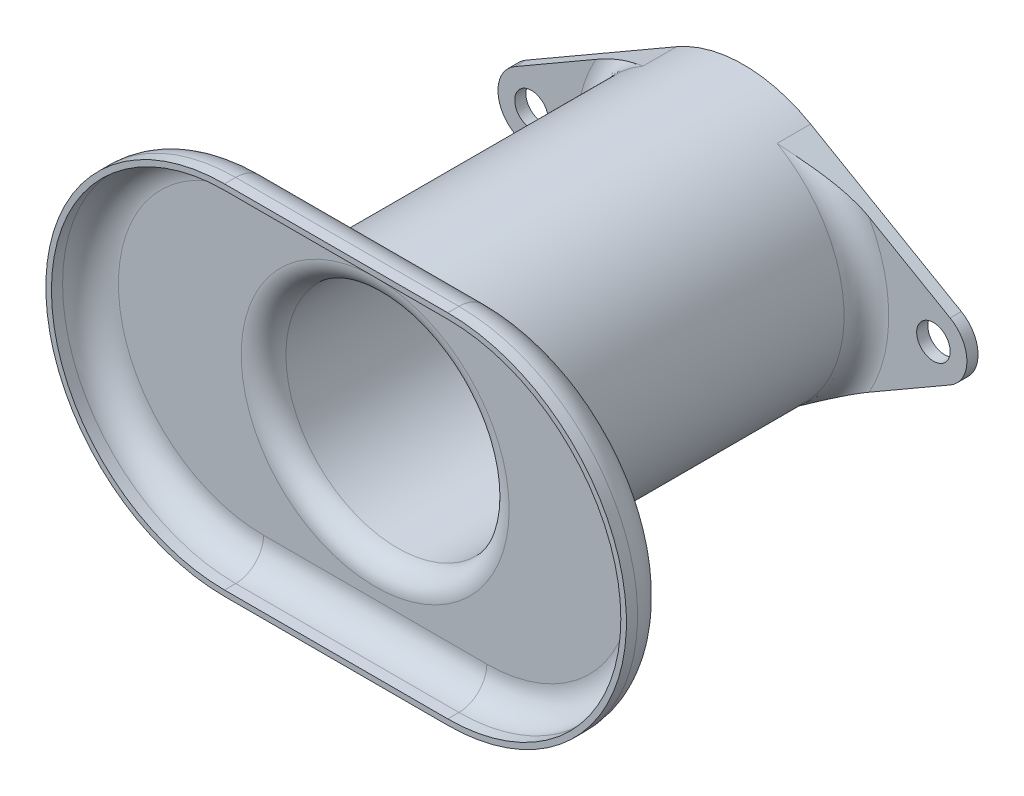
ISO-10303-21;
HEADER;
FILE_DESCRIPTION(('STEP AP214'),'2;1');
FILE_NAME('part.step','',(''),(''),'','','');
FILE_SCHEMA(('AUTOMOTIVE_DESIGN { 1 0 10303 214 1 1 1 1 }'));
ENDSEC;
DATA;
#1=APPLICATION_CONTEXT('core data for automotive mechanical design processes');
#2=APPLICATION_PROTOCOL_DEFINITION('international standard','automotive_design',2000,#1);
#3=PRODUCT_CONTEXT('',#1,'mechanical');
#4=PRODUCT('Part','Part','',(#3));
#5=PRODUCT_RELATED_PRODUCT_CATEGORY('part','',(#4));
#6=PRODUCT_DEFINITION_FORMATION('','',#4);
#7=PRODUCT_DEFINITION_CONTEXT('part definition',#1,'design');
#8=PRODUCT_DEFINITION('design','',#6,#7);
#9=PRODUCT_DEFINITION_SHAPE('','',#8);
#10=(LENGTH_UNIT() NAMED_UNIT(*) SI_UNIT(.MILLI.,.METRE.));
#11=(NAMED_UNIT(*) PLANE_ANGLE_UNIT() SI_UNIT($,.RADIAN.));
#12=(NAMED_UNIT(*) SI_UNIT($,.STERADIAN.) SOLID_ANGLE_UNIT());
#13=UNCERTAINTY_MEASURE_WITH_UNIT(LENGTH_MEASURE(1.E-05),#10,'distance_accuracy_value','');
#14=(GEOMETRIC_REPRESENTATION_CONTEXT(3) GLOBAL_UNCERTAINTY_ASSIGNED_CONTEXT((#13)) GLOBAL_UNIT_ASSIGNED_CONTEXT((#10,
#11,#12)) REPRESENTATION_CONTEXT('',''));
#15=CARTESIAN_POINT('',(0.,0.,0.));
#16=DIRECTION('',(0.,0.,1.));
#17=DIRECTION('',(1.,0.,0.));
#18=AXIS2_PLACEMENT_3D('',#15,#16,#17);
#19=CARTESIAN_POINT('',(-67.9545948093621,33.8932028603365,99.0595145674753));
#20=DIRECTION('',(0.,0.,-1.));
#21=DIRECTION('',(-1.,0.,0.));
#22=AXIS2_PLACEMENT_3D('',#19,#20,#21);
#23=PLANE('',#22);
#24=DIRECTION('',(1.,0.,0.));
#25=VECTOR('',#24,1.);
#26=CARTESIAN_POINT('',(-67.9545948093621,75.1682028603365,99.0595145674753));
#27=LINE('',#26,#25);
#28=CARTESIAN_POINT('',(-67.9545948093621,75.1682028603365,99.0595145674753));
#29=VERTEX_POINT('',#28);
#30=CARTESIAN_POINT('',(-52.7023787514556,75.1682028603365,99.0595145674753));
#31=VERTEX_POINT('',#30);
#32=EDGE_CURVE('E627',#29,#31,#27,.T.);
#33=ORIENTED_EDGE('',*,*,#32,.T.);
#34=CARTESIAN_POINT('',(-36.2045948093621,33.8932028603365,99.0595145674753));
#35=DIRECTION('',(0.,0.,-1.));
#36=DIRECTION('',(-1.,0.,0.));
#37=AXIS2_PLACEMENT_3D('',#34,#35,#36);
#38=CIRCLE('',#37,44.45);
#39=CARTESIAN_POINT('',(-52.7023787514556,-7.38179713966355,99.0595145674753));
#40=VERTEX_POINT('',#39);
#41=EDGE_CURVE('E426',#31,#40,#38,.F.);
#42=ORIENTED_EDGE('',*,*,#41,.T.);
#43=DIRECTION('',(-1.,0.,0.));
#44=VECTOR('',#43,1.);
#45=CARTESIAN_POINT('',(-67.9545948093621,-7.38179713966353,99.0595145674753));
#46=LINE('',#45,#44);
#47=CARTESIAN_POINT('',(-67.954594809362,-7.38179713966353,99.0595145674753));
#48=VERTEX_POINT('',#47);
#49=EDGE_CURVE('E625',#40,#48,#46,.T.);
#50=ORIENTED_EDGE('',*,*,#49,.T.);
#51=CARTESIAN_POINT('',(-67.9545948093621,33.8932028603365,99.0595145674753));
#52=DIRECTION('',(0.,0.,-1.));
#53=DIRECTION('',(-1.,0.,0.));
#54=AXIS2_PLACEMENT_3D('',#51,#52,#53);
#55=CIRCLE('',#54,41.275);
#56=EDGE_CURVE('E706',#48,#29,#55,.T.);
#57=ORIENTED_EDGE('',*,*,#56,.T.);
#58=EDGE_LOOP('',(#33,#42,#50,#57));
#59=FACE_BOUND('',#58,.T.);
#60=ADVANCED_FACE('F36',(#59),#23,.T.);
#61=CARTESIAN_POINT('',(-4.45459480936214,-7.38179713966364,99.0595145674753));
#62=VERTEX_POINT('',#61);
#63=CARTESIAN_POINT('',(-19.7068108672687,-7.38179713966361,99.0595145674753));
#64=VERTEX_POINT('',#63);
#65=EDGE_CURVE('E632',#62,#64,#46,.T.);
#66=ORIENTED_EDGE('',*,*,#65,.T.);
#67=CARTESIAN_POINT('',(-36.2045948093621,33.8932028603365,99.0595145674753));
#68=DIRECTION('',(0.,0.,-1.));
#69=DIRECTION('',(-1.,0.,0.));
#70=AXIS2_PLACEMENT_3D('',#67,#68,#69);
#71=CIRCLE('',#70,44.45);
#72=CARTESIAN_POINT('',(-19.7068108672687,75.1682028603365,99.0595145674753));
#73=VERTEX_POINT('',#72);
#74=EDGE_CURVE('E621',#64,#73,#71,.F.);
#75=ORIENTED_EDGE('',*,*,#74,.T.);
#76=CARTESIAN_POINT('',(-4.45459480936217,75.1682028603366,99.0595145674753));
#77=VERTEX_POINT('',#76);
#78=EDGE_CURVE('E300',#73,#77,#27,.T.);
#79=ORIENTED_EDGE('',*,*,#78,.T.);
#80=CARTESIAN_POINT('',(-4.45459480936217,33.8932028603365,99.0595145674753));
#81=DIRECTION('',(0.,0.,-1.));
#82=DIRECTION('',(-1.,0.,0.));
#83=AXIS2_PLACEMENT_3D('',#80,#81,#82);
#84=CIRCLE('',#83,41.2750000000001);
#85=EDGE_CURVE('E633',#77,#62,#84,.T.);
#86=ORIENTED_EDGE('',*,*,#85,.T.);
#87=EDGE_LOOP('',(#66,#75,#79,#86));
#88=FACE_BOUND('',#87,.T.);
#89=ADVANCED_FACE('F378',(#88),#23,.T.);
#90=CARTESIAN_POINT('',(-67.9545948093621,33.8932028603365,111.759514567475));
#91=DIRECTION('',(0.,0.,-1.));
#92=DIRECTION('',(-1.,0.,0.));
#93=AXIS2_PLACEMENT_3D('',#90,#91,#92);
#94=CYLINDRICAL_SURFACE('',#93,50.8);
#95=DIRECTION('',(0.,0.,-1.));
#96=VECTOR('',#95,1.);
#97=CARTESIAN_POINT('',(-67.9545948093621,84.6932028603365,111.759514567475));
#98=LINE('',#97,#96);
#99=CARTESIAN_POINT('',(-67.9545948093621,84.6932028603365,111.759514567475));
#100=VERTEX_POINT('',#99);
#101=CARTESIAN_POINT('',(-67.9545948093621,84.6932028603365,108.584514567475));
#102=VERTEX_POINT('',#101);
#103=EDGE_CURVE('E296',#100,#102,#98,.T.);
#104=ORIENTED_EDGE('',*,*,#103,.T.);
#105=CARTESIAN_POINT('',(-67.9545948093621,33.8932028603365,108.584514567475));
#106=DIRECTION('',(0.,0.,-1.));
#107=DIRECTION('',(-1.,0.,0.));
#108=AXIS2_PLACEMENT_3D('',#105,#106,#107);
#109=CIRCLE('',#108,50.8);
#110=CARTESIAN_POINT('',(-67.9545948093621,-16.9067971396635,108.584514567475));
#111=VERTEX_POINT('',#110);
#112=EDGE_CURVE('E689',#102,#111,#109,.F.);
#113=ORIENTED_EDGE('',*,*,#112,.T.);
#114=DIRECTION('',(0.,0.,-1.));
#115=VECTOR('',#114,1.);
#116=CARTESIAN_POINT('',(-67.9545948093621,-16.9067971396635,111.759514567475));
#117=LINE('',#116,#115);
#118=CARTESIAN_POINT('',(-67.9545948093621,-16.9067971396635,111.759514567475));
#119=VERTEX_POINT('',#118);
#120=EDGE_CURVE('E297',#119,#111,#117,.T.);
#121=ORIENTED_EDGE('',*,*,#120,.F.);
#122=CARTESIAN_POINT('',(-67.9545948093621,33.8932028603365,111.759514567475));
#123=DIRECTION('',(0.,0.,-1.));
#124=DIRECTION('',(-1.,0.,0.));
#125=AXIS2_PLACEMENT_3D('',#122,#123,#124);
#126=CIRCLE('',#125,50.8);
#127=EDGE_CURVE('E284',#119,#100,#126,.T.);
#128=ORIENTED_EDGE('',*,*,#127,.T.);
#129=EDGE_LOOP('',(#104,#113,#121,#128));
#130=FACE_BOUND('',#129,.T.);
#131=ADVANCED_FACE('F384',(#130),#94,.T.);
#132=CARTESIAN_POINT('',(-4.45459480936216,-16.9067971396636,111.759514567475));
#133=DIRECTION('',(0.,-1.,0.));
#134=DIRECTION('',(1.,0.,0.));
#135=AXIS2_PLACEMENT_3D('',#132,#133,#134);
#136=PLANE('',#135);
#137=ORIENTED_EDGE('',*,*,#120,.T.);
#138=DIRECTION('',(-1.,0.,0.));
#139=VECTOR('',#138,1.);
#140=CARTESIAN_POINT('',(-4.45459480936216,-16.9067971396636,108.584514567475));
#141=LINE('',#140,#139);
#142=CARTESIAN_POINT('',(-4.45459480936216,-16.9067971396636,108.584514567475));
#143=VERTEX_POINT('',#142);
#144=EDGE_CURVE('E702',#111,#143,#141,.F.);
#145=ORIENTED_EDGE('',*,*,#144,.T.);
#146=DIRECTION('',(0.,0.,-1.));
#147=VECTOR('',#146,1.);
#148=CARTESIAN_POINT('',(-4.45459480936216,-16.9067971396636,111.759514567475));
#149=LINE('',#148,#147);
#150=CARTESIAN_POINT('',(-4.45459480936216,-16.9067971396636,111.759514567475));
#151=VERTEX_POINT('',#150);
#152=EDGE_CURVE('E301',#151,#143,#149,.T.);
#153=ORIENTED_EDGE('',*,*,#152,.F.);
#154=DIRECTION('',(-1.,0.,0.));
#155=VECTOR('',#154,1.);
#156=CARTESIAN_POINT('',(-4.45459480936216,-16.9067971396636,111.759514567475));
#157=LINE('',#156,#155);
#158=EDGE_CURVE('E293',#151,#119,#157,.T.);
#159=ORIENTED_EDGE('',*,*,#158,.T.);
#160=EDGE_LOOP('',(#137,#145,#153,#159));
#161=FACE_BOUND('',#160,.T.);
#162=ADVANCED_FACE('F390',(#161),#136,.T.);
#163=CARTESIAN_POINT('',(-4.45459480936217,33.8932028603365,111.759514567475));
#164=DIRECTION('',(0.,0.,-1.));
#165=DIRECTION('',(-1.,0.,0.));
#166=AXIS2_PLACEMENT_3D('',#163,#164,#165);
#167=CYLINDRICAL_SURFACE('',#166,50.8000000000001);
#168=ORIENTED_EDGE('',*,*,#152,.T.);
#169=CARTESIAN_POINT('',(-4.45459480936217,33.8932028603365,108.584514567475));
#170=DIRECTION('',(0.,0.,-1.));
#171=DIRECTION('',(-1.,0.,0.));
#172=AXIS2_PLACEMENT_3D('',#169,#170,#171);
#173=CIRCLE('',#172,50.8000000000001);
#174=CARTESIAN_POINT('',(-4.45459480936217,84.6932028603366,108.584514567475));
#175=VERTEX_POINT('',#174);
#176=EDGE_CURVE('E700',#143,#175,#173,.F.);
#177=ORIENTED_EDGE('',*,*,#176,.T.);
#178=DIRECTION('',(0.,0.,-1.));
#179=VECTOR('',#178,1.);
#180=CARTESIAN_POINT('',(-4.45459480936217,84.6932028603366,111.759514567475));
#181=LINE('',#180,#179);
#182=CARTESIAN_POINT('',(-4.45459480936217,84.6932028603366,111.759514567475));
#183=VERTEX_POINT('',#182);
#184=EDGE_CURVE('E304',#183,#175,#181,.T.);
#185=ORIENTED_EDGE('',*,*,#184,.F.);
#186=CARTESIAN_POINT('',(-4.45459480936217,33.8932028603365,111.759514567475));
#187=DIRECTION('',(0.,0.,-1.));
#188=DIRECTION('',(-1.,0.,0.));
#189=AXIS2_PLACEMENT_3D('',#186,#187,#188);
#190=CIRCLE('',#189,50.8000000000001);
#191=EDGE_CURVE('E290',#183,#151,#190,.T.);
#192=ORIENTED_EDGE('',*,*,#191,.T.);
#193=EDGE_LOOP('',(#168,#177,#185,#192));
#194=FACE_BOUND('',#193,.T.);
#195=ADVANCED_FACE('F393',(#194),#167,.T.);
#196=CARTESIAN_POINT('',(-67.9545948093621,84.6932028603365,111.759514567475));
#197=DIRECTION('',(0.,1.,0.));
#198=DIRECTION('',(-1.,0.,0.));
#199=AXIS2_PLACEMENT_3D('',#196,#197,#198);
#200=PLANE('',#199);
#201=ORIENTED_EDGE('',*,*,#184,.T.);
#202=DIRECTION('',(1.,0.,0.));
#203=VECTOR('',#202,1.);
#204=CARTESIAN_POINT('',(-67.9545948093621,84.6932028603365,108.584514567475));
#205=LINE('',#204,#203);
#206=EDGE_CURVE('E686',#175,#102,#205,.F.);
#207=ORIENTED_EDGE('',*,*,#206,.T.);
#208=ORIENTED_EDGE('',*,*,#103,.F.);
#209=DIRECTION('',(1.,0.,0.));
#210=VECTOR('',#209,1.);
#211=CARTESIAN_POINT('',(-67.9545948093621,84.6932028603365,111.759514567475));
#212=LINE('',#211,#210);
#213=EDGE_CURVE('E287',#100,#183,#212,.T.);
#214=ORIENTED_EDGE('',*,*,#213,.T.);
#215=EDGE_LOOP('',(#201,#207,#208,#214));
#216=FACE_BOUND('',#215,.T.);
#217=ADVANCED_FACE('F397',(#216),#200,.T.);
#218=CARTESIAN_POINT('',(-67.9545948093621,33.8932028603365,111.759514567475));
#219=DIRECTION('',(0.,0.,-1.));
#220=DIRECTION('',(-1.,0.,0.));
#221=AXIS2_PLACEMENT_3D('',#218,#219,#220);
#222=PLANE('',#221);
#223=DIRECTION('',(1.,0.,0.));
#224=VECTOR('',#223,1.);
#225=CARTESIAN_POINT('',(-67.9545948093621,-15.3192971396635,111.759514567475));
#226=LINE('',#225,#224);
#227=CARTESIAN_POINT('',(-67.9545948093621,-15.3192971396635,111.759514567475));
#228=VERTEX_POINT('',#227);
#229=CARTESIAN_POINT('',(-4.45459480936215,-15.3192971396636,111.759514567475));
#230=VERTEX_POINT('',#229);
#231=EDGE_CURVE('E224',#228,#230,#226,.T.);
#232=ORIENTED_EDGE('',*,*,#231,.F.);
#233=CARTESIAN_POINT('',(-67.9545948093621,33.8932028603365,111.759514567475));
#234=DIRECTION('',(0.,0.,1.));
#235=DIRECTION('',(1.,0.,0.));
#236=AXIS2_PLACEMENT_3D('',#233,#234,#235);
#237=CIRCLE('',#236,49.2125);
#238=CARTESIAN_POINT('',(-67.9545948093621,83.1057028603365,111.759514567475));
#239=VERTEX_POINT('',#238);
#240=EDGE_CURVE('E229',#239,#228,#237,.T.);
#241=ORIENTED_EDGE('',*,*,#240,.F.);
#242=DIRECTION('',(-1.,0.,0.));
#243=VECTOR('',#242,1.);
#244=CARTESIAN_POINT('',(-4.45459480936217,83.1057028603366,111.759514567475));
#245=LINE('',#244,#243);
#246=CARTESIAN_POINT('',(-4.45459480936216,83.1057028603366,111.759514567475));
#247=VERTEX_POINT('',#246);
#248=EDGE_CURVE('E234',#247,#239,#245,.T.);
#249=ORIENTED_EDGE('',*,*,#248,.F.);
#250=CARTESIAN_POINT('',(-4.45459480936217,33.8932028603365,111.759514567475));
#251=DIRECTION('',(0.,0.,1.));
#252=DIRECTION('',(1.,0.,0.));
#253=AXIS2_PLACEMENT_3D('',#250,#251,#252);
#254=CIRCLE('',#253,49.2125000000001);
#255=EDGE_CURVE('E214',#230,#247,#254,.T.);
#256=ORIENTED_EDGE('',*,*,#255,.F.);
#257=EDGE_LOOP('',(#232,#241,#249,#256));
#258=FACE_BOUND('',#257,.T.);
#259=ORIENTED_EDGE('',*,*,#127,.F.);
#260=ORIENTED_EDGE('',*,*,#158,.F.);
#261=ORIENTED_EDGE('',*,*,#191,.F.);
#262=ORIENTED_EDGE('',*,*,#213,.F.);
#263=EDGE_LOOP('',(#259,#260,#261,#262));
#264=FACE_BOUND('',#263,.T.);
#265=ADVANCED_FACE('F231',(#258,#264),#222,.F.);
#266=CARTESIAN_POINT('',(-36.2045948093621,33.8932028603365,-0.940485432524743));
#267=DIRECTION('',(0.,0.,1.));
#268=DIRECTION('',(1.,0.,0.));
#269=AXIS2_PLACEMENT_3D('',#266,#267,#268);
#270=CYLINDRICAL_SURFACE('',#269,38.1);
#271=CARTESIAN_POINT('',(-36.2045948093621,33.8932028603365,92.7095145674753));
#272=DIRECTION('',(0.,0.,-1.));
#273=DIRECTION('',(-1.,0.,0.));
#274=AXIS2_PLACEMENT_3D('',#271,#272,#273);
#275=CIRCLE('',#274,38.1);
#276=CARTESIAN_POINT('',(-50.3455524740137,-1.48536856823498,92.7095145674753));
#277=VERTEX_POINT('',#276);
#278=CARTESIAN_POINT('',(-50.3455524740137,69.2717742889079,92.7095145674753));
#279=VERTEX_POINT('',#278);
#280=EDGE_CURVE('E481',#277,#279,#275,.T.);
#281=ORIENTED_EDGE('',*,*,#280,.T.);
#282=CARTESIAN_POINT('',(-59.4732074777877,64.0624200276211,93.9189546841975));
#283=CARTESIAN_POINT('',(-57.7861290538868,65.3636130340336,102.337143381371));
#284=CARTESIAN_POINT('',(-63.351309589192,71.5216548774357,99.7851786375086));
#285=CARTESIAN_POINT('',(-59.1899464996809,64.2809134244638,93.8133392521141));
#286=CARTESIAN_POINT('',(-57.6088326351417,65.4753017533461,102.166313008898));
#287=CARTESIAN_POINT('',(-63.0208384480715,71.6746002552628,99.7218093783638));
#288=CARTESIAN_POINT('',(-58.9020740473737,64.4965560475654,93.7168445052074));
#289=CARTESIAN_POINT('',(-57.4201474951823,65.5943140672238,101.999426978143));
#290=CARTESIAN_POINT('',(-62.6849872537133,71.8255500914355,99.6639125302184));
#291=CARTESIAN_POINT('',(-58.3179806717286,64.9212245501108,93.5404870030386));
#292=CARTESIAN_POINT('',(-57.0234142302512,65.8424928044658,101.677653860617));
#293=CARTESIAN_POINT('',(-62.0035449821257,72.1228180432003,99.5580980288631));
#294=CARTESIAN_POINT('',(-58.0217627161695,65.1302527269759,93.4606184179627));
#295=CARTESIAN_POINT('',(-56.8156436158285,65.9715147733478,101.522579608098));
#296=CARTESIAN_POINT('',(-61.6579573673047,72.2691377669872,99.5101768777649));
#297=CARTESIAN_POINT('',(-57.4220747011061,65.5406430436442,93.3159337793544));
#298=CARTESIAN_POINT('',(-56.3820180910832,66.2367639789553,101.225517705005));
#299=CARTESIAN_POINT('',(-60.9583213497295,72.5564109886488,99.4233660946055));
#300=CARTESIAN_POINT('',(-57.1186154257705,65.7420155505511,93.2510967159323));
#301=CARTESIAN_POINT('',(-56.156413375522,66.3728978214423,101.083307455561));
#302=CARTESIAN_POINT('',(-60.6042855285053,72.6973717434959,99.3844638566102));
#303=CARTESIAN_POINT('',(-56.5047056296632,66.136787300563,93.134762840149));
#304=CARTESIAN_POINT('',(-55.6881422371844,66.649892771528,100.81204459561));
#305=CARTESIAN_POINT('',(-59.888057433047,72.9737119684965,99.3146635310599));
#306=CARTESIAN_POINT('',(-56.1942544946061,66.3301858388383,93.0832672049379));
#307=CARTESIAN_POINT('',(-55.4456422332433,66.7907278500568,100.68277740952));
#308=CARTESIAN_POINT('',(-59.5258644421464,73.1090909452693,99.2837661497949));
#309=CARTESIAN_POINT('',(-55.2588245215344,66.8943110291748,92.9473170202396));
#310=CARTESIAN_POINT('',(-54.7035263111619,67.2115611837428,100.319230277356));
#311=CARTESIAN_POINT('',(-58.4345294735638,73.5039785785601,99.2021960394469));
#312=CARTESIAN_POINT('',(-54.6244317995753,67.2526223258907,92.880173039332));
#313=CARTESIAN_POINT('',(-54.176492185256,67.4978786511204,100.100626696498));
#314=CARTESIAN_POINT('',(-57.6944046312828,73.7547964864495,99.1619096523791));
#315=CARTESIAN_POINT('',(-53.3346718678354,67.9329199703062,92.7814866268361));
#316=CARTESIAN_POINT('',(-53.0697862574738,68.0638552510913,99.7125542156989));
#317=CARTESIAN_POINT('',(-56.1896847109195,74.2310048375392,99.1026978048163));
#318=CARTESIAN_POINT('',(-52.6793048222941,68.2549066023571,92.7499439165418));
#319=CARTESIAN_POINT('',(-52.4903252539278,68.3441807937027,99.5416007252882));
#320=CARTESIAN_POINT('',(-55.4250898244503,74.4563954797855,99.0837721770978));
#321=CARTESIAN_POINT('',(-51.7398797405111,68.6833811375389,92.7236873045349));
#322=CARTESIAN_POINT('',(-51.6350487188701,68.7299365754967,99.3288276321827));
#323=CARTESIAN_POINT('',(-54.3290938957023,74.7563276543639,99.0680182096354));
#324=CARTESIAN_POINT('',(-51.4631162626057,68.8056512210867,92.718223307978));
#325=CARTESIAN_POINT('',(-51.3822366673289,68.8408009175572,99.2703996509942));
#326=CARTESIAN_POINT('',(-54.0062031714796,74.8419167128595,99.064739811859));
#327=CARTESIAN_POINT('',(-50.9065422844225,69.0436569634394,92.7111384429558));
#328=CARTESIAN_POINT('',(-50.8695751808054,69.0589057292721,99.1602196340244));
#329=CARTESIAN_POINT('',(-53.3568668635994,75.0085207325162,99.0604888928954));
#330=CARTESIAN_POINT('',(-50.626729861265,69.1593881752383,92.7095201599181));
#331=CARTESIAN_POINT('',(-50.6096773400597,69.1662159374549,99.1083963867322));
#332=CARTESIAN_POINT('',(-53.0304190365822,75.0895325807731,99.0595179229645));
#333=CARTESIAN_POINT('',(-49.3676612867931,69.6626356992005,92.7094951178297));
#334=CARTESIAN_POINT('',(-49.4425324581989,69.6326691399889,98.8923918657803));
#335=CARTESIAN_POINT('',(-51.5615056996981,75.441805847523,99.059502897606));
#336=CARTESIAN_POINT('',(-48.3732603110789,70.0130368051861,92.7289818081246));
#337=CARTESIAN_POINT('',(-48.4868869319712,69.9743221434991,98.7591100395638));
#338=CARTESIAN_POINT('',(-50.4013712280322,75.6870866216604,99.071194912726));
#339=CARTESIAN_POINT('',(-46.3585723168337,70.6303494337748,92.7847013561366));
#340=CARTESIAN_POINT('',(-46.5209869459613,70.5844072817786,98.5489357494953));
#341=CARTESIAN_POINT('',(-48.050901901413,76.1192054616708,99.1046266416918));
#342=CARTESIAN_POINT('',(-45.3382663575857,70.8971978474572,92.8209468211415));
#343=CARTESIAN_POINT('',(-45.5066871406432,70.8558674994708,98.4703874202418));
#344=CARTESIAN_POINT('',(-46.8605449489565,76.3059993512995,99.1263739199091));
#345=CARTESIAN_POINT('',(-43.7928229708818,71.2336347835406,92.8748385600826));
#346=CARTESIAN_POINT('',(-43.9519490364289,71.2013074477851,98.3805735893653));
#347=CARTESIAN_POINT('',(-45.0575276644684,76.5415052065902,99.1587089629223));
#348=CARTESIAN_POINT('',(-43.2744913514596,71.3352318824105,92.8927461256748));
#349=CARTESIAN_POINT('',(-43.4293802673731,71.3060990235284,98.3552841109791));
#350=CARTESIAN_POINT('',(-44.4528074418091,76.6126231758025,99.1694535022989));
#351=CARTESIAN_POINT('',(-42.2340229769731,71.5167964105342,92.9267025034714));
#352=CARTESIAN_POINT('',(-42.3768540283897,71.4939630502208,98.3122748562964));
#353=CARTESIAN_POINT('',(-43.238927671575,76.7397183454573,99.1898273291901));
#354=CARTESIAN_POINT('',(-41.7118865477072,71.5967656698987,92.9427514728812));
#355=CARTESIAN_POINT('',(-41.8462074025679,71.5772981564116,98.2944792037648));
#356=CARTESIAN_POINT('',(-42.6297685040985,76.7956968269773,99.199456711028));
#357=CARTESIAN_POINT('',(-40.6647765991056,71.7349209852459,92.9715611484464));
#358=CARTESIAN_POINT('',(-40.779619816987,71.7215057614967,98.2649648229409));
#359=CARTESIAN_POINT('',(-41.40814023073,76.8924055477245,99.2167425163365));
#360=CARTESIAN_POINT('',(-40.1398036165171,71.7931110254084,92.9843224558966));
#361=CARTESIAN_POINT('',(-40.2429504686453,71.7825861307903,98.2531965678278));
#362=CARTESIAN_POINT('',(-40.7956717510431,76.9331385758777,99.2243993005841));
#363=CARTESIAN_POINT('',(-39.0878761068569,71.887617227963,93.0055158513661));
#364=CARTESIAN_POINT('',(-39.166247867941,71.8818302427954,98.2346217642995));
#365=CARTESIAN_POINT('',(-39.5684229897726,76.9992929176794,99.2371153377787));
#366=CARTESIAN_POINT('',(-38.5609217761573,71.9239355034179,93.0139483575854));
#367=CARTESIAN_POINT('',(-38.6254571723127,71.9201380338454,98.2277861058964));
#368=CARTESIAN_POINT('',(-38.9536429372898,77.0247157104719,99.2421748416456));
#369=CARTESIAN_POINT('',(-37.500509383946,71.9748947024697,93.0258800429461));
#370=CARTESIAN_POINT('',(-37.53687574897,71.9738491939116,98.2183178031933));
#371=CARTESIAN_POINT('',(-37.7164951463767,77.0603871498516,99.2493338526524));
#372=CARTESIAN_POINT('',(-36.967040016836,71.9893096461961,93.0293277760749));
#373=CARTESIAN_POINT('',(-36.9882649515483,71.9890930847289,98.2157146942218));
#374=CARTESIAN_POINT('',(-37.0941142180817,77.0704776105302,99.2514024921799));
#375=CARTESIAN_POINT('',(-35.8999588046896,71.9957208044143,93.0308541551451));
#376=CARTESIAN_POINT('',(-35.8915632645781,71.9958602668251,98.2145509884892));
#377=CARTESIAN_POINT('',(-35.8491861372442,77.0749654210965,99.2523183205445));
#378=CARTESIAN_POINT('',(-35.3663469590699,71.9877169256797,93.0289327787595));
#379=CARTESIAN_POINT('',(-35.3426652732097,71.9873934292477,98.215988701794));
#380=CARTESIAN_POINT('',(-35.2266389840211,77.0693627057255,99.2511654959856));
#381=CARTESIAN_POINT('',(-34.2998472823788,71.9493025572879,93.0198710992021));
#382=CARTESIAN_POINT('',(-34.2472620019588,71.9468782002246,98.2230529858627));
#383=CARTESIAN_POINT('',(-33.9823893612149,77.0424726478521,99.2457284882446));
#384=CARTESIAN_POINT('',(-33.7669596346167,71.9188871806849,93.0127296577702));
#385=CARTESIAN_POINT('',(-33.6999539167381,71.9147650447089,98.2286909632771));
#386=CARTESIAN_POINT('',(-33.3606871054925,77.0211818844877,99.241443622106));
#387=CARTESIAN_POINT('',(-32.7029972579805,71.835706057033,92.9937972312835));
#388=CARTESIAN_POINT('',(-32.6098375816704,71.8273033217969,98.2447373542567));
#389=CARTESIAN_POINT('',(-32.1193976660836,76.9629550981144,99.230084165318));
#390=CARTESIAN_POINT('',(-32.1719225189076,71.7829404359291,92.9820062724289));
#391=CARTESIAN_POINT('',(-32.0662410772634,71.7718269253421,98.2551706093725));
#392=CARTESIAN_POINT('',(-31.4998104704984,76.926019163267,99.223009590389));
#393=CARTESIAN_POINT('',(-31.1134944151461,71.6552780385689,92.9547754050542));
#394=CARTESIAN_POINT('',(-30.9865156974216,71.6383253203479,98.2817807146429));
#395=CARTESIAN_POINT('',(-30.2649776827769,76.8366554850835,99.206671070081));
#396=CARTESIAN_POINT('',(-30.5861360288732,71.5804218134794,92.939342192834));
#397=CARTESIAN_POINT('',(-30.4496127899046,71.5601483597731,98.2979907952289));
#398=CARTESIAN_POINT('',(-29.6497262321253,76.784256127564,99.1974111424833));
#399=CARTESIAN_POINT('',(-29.5350722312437,71.4086800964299,92.9061664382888));
#400=CARTESIAN_POINT('',(-29.3842388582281,71.3819884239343,98.3375361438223));
#401=CARTESIAN_POINT('',(-28.4234851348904,76.6640369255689,99.1775056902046));
#402=CARTESIAN_POINT('',(-29.0113668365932,71.311794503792,92.88842388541));
#403=CARTESIAN_POINT('',(-28.8550482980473,71.2817523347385,98.3609406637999));
#404=CARTESIAN_POINT('',(-27.8124955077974,76.5962170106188,99.1668601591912));
#405=CARTESIAN_POINT('',(-27.9687457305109,71.0962138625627,92.8523440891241));
#406=CARTESIAN_POINT('',(-27.8073741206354,71.0605526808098,98.4165893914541));
#407=CARTESIAN_POINT('',(-26.596104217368,76.4453105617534,99.1452122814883));
#408=CARTESIAN_POINT('',(-27.4498277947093,70.9775295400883,92.8340071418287));
#409=CARTESIAN_POINT('',(-27.2882141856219,70.9392918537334,98.4489327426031));
#410=CARTESIAN_POINT('',(-25.9906999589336,76.3622315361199,99.1342101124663));
#411=CARTESIAN_POINT('',(-26.4174347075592,70.7185300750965,92.7987677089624));
#412=CARTESIAN_POINT('',(-26.262459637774,70.6773242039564,98.5244894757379));
#413=CARTESIAN_POINT('',(-24.786241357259,76.1809319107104,99.1130664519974));
#414=CARTESIAN_POINT('',(-25.9039591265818,70.578216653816,92.7818651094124));
#415=CARTESIAN_POINT('',(-25.755256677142,70.5362660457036,98.5678497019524));
#416=CARTESIAN_POINT('',(-24.1871865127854,76.0827125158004,99.1029248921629));
#417=CARTESIAN_POINT('',(-24.8298439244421,70.260367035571,92.7502611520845));
#418=CARTESIAN_POINT('',(-24.7026810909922,70.2204455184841,98.6730134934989));
#419=CARTESIAN_POINT('',(-22.9340521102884,75.8602177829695,99.0839625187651));
#420=CARTESIAN_POINT('',(-24.2698885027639,70.0804725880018,92.7359749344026));
#421=CARTESIAN_POINT('',(-24.1587982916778,70.0433866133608,98.7364720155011));
#422=CARTESIAN_POINT('',(-22.2807707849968,75.7342916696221,99.0753907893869));
#423=CARTESIAN_POINT('',(-23.4369916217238,69.7914554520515,92.7206992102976));
#424=CARTESIAN_POINT('',(-23.3618653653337,69.7646488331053,98.8457658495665));
#425=CARTESIAN_POINT('',(-21.309057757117,75.5319796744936,99.0662253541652));
#426=CARTESIAN_POINT('',(-23.1607069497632,69.6919904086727,92.7166335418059));
#427=CARTESIAN_POINT('',(-23.0981238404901,69.6690536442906,98.8847657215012));
#428=CARTESIAN_POINT('',(-20.98672563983,75.4623541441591,99.0637859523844));
#429=CARTESIAN_POINT('',(-22.6104146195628,69.4866651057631,92.7110427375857));
#430=CARTESIAN_POINT('',(-22.5761806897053,69.4734743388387,98.9680747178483));
#431=CARTESIAN_POINT('',(-20.344717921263,75.3186264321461,99.0604314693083));
#432=CARTESIAN_POINT('',(-22.3364076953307,69.3808028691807,92.7095183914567));
#433=CARTESIAN_POINT('',(-22.3179193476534,69.3734203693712,99.0124388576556));
#434=CARTESIAN_POINT('',(-20.0250431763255,75.2445228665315,99.059516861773));
#435=CARTESIAN_POINT('',(-21.2468544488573,68.9452996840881,92.7095031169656));
#436=CARTESIAN_POINT('',(-21.2907736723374,68.9628319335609,99.2025961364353));
#437=CARTESIAN_POINT('',(-18.7538977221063,74.9396706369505,99.0595076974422));
#438=CARTESIAN_POINT('',(-20.4411575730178,68.5904343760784,92.7231252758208));
#439=CARTESIAN_POINT('',(-20.5526576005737,68.6383516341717,99.37112760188));
#440=CARTESIAN_POINT('',(-17.8139180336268,74.6912649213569,99.0676809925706));
#441=CARTESIAN_POINT('',(-18.8573171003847,67.8262893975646,92.7930102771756));
#442=CARTESIAN_POINT('',(-19.1451056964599,67.9711657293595,99.7700899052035));
#443=CARTESIAN_POINT('',(-15.9661041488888,74.1563634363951,99.1096119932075));
#444=CARTESIAN_POINT('',(-18.079168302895,67.4170200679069,92.8492650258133));
#445=CARTESIAN_POINT('',(-18.4753444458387,67.6269401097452,100.002801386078));
#446=CARTESIAN_POINT('',(-15.0582638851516,73.8698749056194,99.1433648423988));
#447=CARTESIAN_POINT('',(-16.9331740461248,66.7629311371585,92.9795235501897));
#448=CARTESIAN_POINT('',(-17.5366341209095,67.1157532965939,100.4026398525));
#449=CARTESIAN_POINT('',(-13.7212705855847,73.4120126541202,99.2215199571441));
#450=CARTESIAN_POINT('',(-16.5526553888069,66.536830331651,93.0310065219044));
#451=CARTESIAN_POINT('',(-17.2298749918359,66.9432214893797,100.547359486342));
#452=CARTESIAN_POINT('',(-13.2773321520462,73.2537420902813,99.252409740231));
#453=CARTESIAN_POINT('',(-15.8012577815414,66.0725252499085,93.1520345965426));
#454=CARTESIAN_POINT('',(-16.6396498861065,66.6028551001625,100.855313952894));
#455=CARTESIAN_POINT('',(-12.4007016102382,72.9287285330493,99.3250265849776));
#456=CARTESIAN_POINT('',(-15.4303774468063,65.8343227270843,93.2215770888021));
#457=CARTESIAN_POINT('',(-16.3564202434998,66.4350143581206,101.01892559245));
#458=CARTESIAN_POINT('',(-11.9680078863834,72.7619867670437,99.3667520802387));
#459=CARTESIAN_POINT('',(-14.6984920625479,65.346203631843,93.3816035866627));
#460=CARTESIAN_POINT('',(-15.8146988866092,66.1078684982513,101.364921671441));
#461=CARTESIAN_POINT('',(-11.1141416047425,72.4203034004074,99.4627679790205));
#462=CARTESIAN_POINT('',(-14.3375118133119,65.0962612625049,93.4721356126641));
#463=CARTESIAN_POINT('',(-15.5566281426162,65.9486913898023,101.547718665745));
#464=CARTESIAN_POINT('',(-10.692997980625,72.2453437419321,99.517087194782));
#465=CARTESIAN_POINT('',(-13.6274385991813,64.586425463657,93.6769828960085));
#466=CARTESIAN_POINT('',(-15.0675121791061,65.6438208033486,101.930552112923));
#467=CARTESIAN_POINT('',(-9.8645792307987,71.888458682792,99.639995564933));
#468=CARTESIAN_POINT('',(-13.2783526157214,64.3265263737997,93.7913118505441));
#469=CARTESIAN_POINT('',(-14.8369434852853,65.4983616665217,102.130931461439));
#470=CARTESIAN_POINT('',(-9.45731225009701,71.7065293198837,99.708592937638));
#471=CARTESIAN_POINT('',(-12.9359821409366,64.0624200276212,93.9189546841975));
#472=CARTESIAN_POINT('',(-14.6230605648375,65.3636130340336,102.337143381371));
#473=CARTESIAN_POINT('',(-9.05788002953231,71.5216548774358,99.7851786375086));
#474=(BOUNDED_SURFACE() B_SPLINE_SURFACE(3,2,((#282,#283,#284),(#285,#286,#287),(#288,#289,
#290),(#291,#292,#293),(#294,#295,#296),(#297,#298,#299),(#300,#301,#302),(#303,#304,#305),
(#306,#307,#308),(#309,#310,#311),(#312,#313,#314),(#315,#316,#317),(#318,#319,#320),(#321,#322,
#323),(#324,#325,#326),(#327,#328,#329),(#330,#331,#332),(#333,#334,#335),(#336,#337,#338),
(#339,#340,#341),(#342,#343,#344),(#345,#346,#347),(#348,#349,#350),(#351,#352,#353),(#354,#355,
#356),(#357,#358,#359),(#360,#361,#362),(#363,#364,#365),(#366,#367,#368),(#369,#370,#371),
(#372,#373,#374),(#375,#376,#377),(#378,#379,#380),(#381,#382,#383),(#384,#385,#386),(#387,#388,
#389),(#390,#391,#392),(#393,#394,#395),(#396,#397,#398),(#399,#400,#401),(#402,#403,#404),
(#405,#406,#407),(#408,#409,#410),(#411,#412,#413),(#414,#415,#416),(#417,#418,#419),(#420,#421,
#422),(#423,#424,#425),(#426,#427,#428),(#429,#430,#431),(#432,#433,#434),(#435,#436,#437),
(#438,#439,#440),(#441,#442,#443),(#444,#445,#446),(#447,#448,#449),(#450,#451,#452),(#453,#454,
#455),(#456,#457,#458),(#459,#460,#461),(#462,#463,#464),(#465,#466,#467),(#468,#469,#470),
(#471,#472,#473)),.UNSPECIFIED.,.F.,.F.,.F.) B_SPLINE_SURFACE_WITH_KNOTS((4,2,2,2,2,2,2,2,2,2,2,
2,2,2,2,2,2,2,2,2,2,2,2,2,2,2,2,2,2,2,2,4),(3,3),(0.,1.29129397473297,2.58213440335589,
3.87115956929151,5.16029843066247,7.71570712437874,10.2710958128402,11.3301145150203,
12.389844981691,16.0754225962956,19.7637773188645,21.6127880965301,23.4616423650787,
25.3101582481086,27.1584955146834,29.0257758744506,30.893063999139,32.7607594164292,
34.6284443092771,36.492721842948,38.3570078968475,40.220379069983,42.083602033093,
44.1417038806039,45.16943760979,46.1974906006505,49.2758870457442,52.3536991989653,
53.9100398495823,55.4661556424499,57.0258673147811,58.5864792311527),(0.,1.),
.UNSPECIFIED.) GEOMETRIC_REPRESENTATION_ITEM() RATIONAL_B_SPLINE_SURFACE(((1.,0.590275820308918,
1.),(1.,0.594731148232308,1.),(1.,0.599194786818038,1.),(1.,0.608100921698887,1.),(1.,
0.612543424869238,1.),(1.,0.621366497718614,1.),(1.,0.62574714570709,1.),(1.,0.634422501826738,
1.),(1.,0.638717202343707,1.),(1.,0.651356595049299,1.),(1.,0.659535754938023,1.),(1.,
0.675275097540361,1.),(1.,0.682835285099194,1.),(1.,0.693001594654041,1.),(1.,0.695916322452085,
1.),(1.,0.701613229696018,1.),(1.,0.704395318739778,1.),(1.,0.716536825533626,1.),(1.,
0.725112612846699,1.),(1.,0.740339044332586,1.),(1.,0.746988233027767,1.),(1.,0.755412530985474,
1.),(1.,0.75796469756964,1.),(1.,0.762535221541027,1.),(1.,0.764553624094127,1.),(1.,
0.768045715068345,1.),(1.,0.76951950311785,1.),(1.,0.771915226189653,1.),(1.,0.772837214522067,
1.),(1.,0.774131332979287,1.),(1.,0.774497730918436,1.),(1.,0.77466065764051,1.),(1.,
0.774457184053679,1.),(1.,0.773481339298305,1.),(1.,0.772708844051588,1.),(1.,0.770598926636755,
1.),(1.,0.769261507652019,1.),(1.,0.766031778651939,1.),(1.,0.764140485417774,1.),(1.,
0.759812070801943,1.),(1.,0.75737494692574,1.),(1.,0.751969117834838,1.),(1.,0.74900067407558,
1.),(1.,0.742547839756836,1.),(1.,0.73906349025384,1.),(1.,0.731207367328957,1.),(1.,
0.726780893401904,1.),(1.,0.71971451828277,1.),(1.,0.717289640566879,1.),(1.,0.712301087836,1.),
(1.,0.709737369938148,1.),(1.,0.699229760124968,1.),(1.,0.690753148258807,1.),(1.,
0.672780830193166,1.),(1.,0.663285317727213,1.),(1.,0.648417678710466,1.),(1.,0.643327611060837,
1.),(1.,0.632997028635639,1.),(1.,0.627756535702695,1.),(1.,0.61716238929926,1.),(1.,
0.611808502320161,1.),(1.,0.601057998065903,1.),(1.,0.595661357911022,1.),(1.,0.590275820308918,1.))) REPRESENTATION_ITEM('') SURFACE());
#475=CARTESIAN_POINT('',(-59.4732074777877,64.0624200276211,93.9189546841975));
#476=CARTESIAN_POINT('',(-59.1899464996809,64.2809134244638,93.8133392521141));
#477=CARTESIAN_POINT('',(-58.9020740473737,64.4965560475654,93.7168445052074));
#478=CARTESIAN_POINT('',(-58.3179806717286,64.9212245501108,93.5404870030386));
#479=CARTESIAN_POINT('',(-58.0217627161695,65.1302527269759,93.4606184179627));
#480=CARTESIAN_POINT('',(-57.4220747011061,65.5406430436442,93.3159337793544));
#481=CARTESIAN_POINT('',(-57.1186154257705,65.7420155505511,93.2510967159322));
#482=CARTESIAN_POINT('',(-56.5047056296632,66.136787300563,93.134762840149));
#483=CARTESIAN_POINT('',(-56.1942544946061,66.3301858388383,93.0832672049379));
#484=CARTESIAN_POINT('',(-55.2588245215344,66.8943110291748,92.9473170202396));
#485=CARTESIAN_POINT('',(-54.6244317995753,67.2526223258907,92.880173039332));
#486=CARTESIAN_POINT('',(-53.3346718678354,67.9329199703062,92.7814866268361));
#487=CARTESIAN_POINT('',(-52.6793048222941,68.2549066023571,92.7499439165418));
#488=CARTESIAN_POINT('',(-51.7398797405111,68.6833811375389,92.7236873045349));
#489=CARTESIAN_POINT('',(-51.4631162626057,68.8056512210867,92.718223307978));
#490=CARTESIAN_POINT('',(-50.9065422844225,69.0436569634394,92.7111384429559));
#491=CARTESIAN_POINT('',(-50.626729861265,69.1593881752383,92.7095201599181));
#492=CARTESIAN_POINT('',(-49.3676612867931,69.6626356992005,92.7094951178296));
#493=CARTESIAN_POINT('',(-48.3732603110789,70.0130368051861,92.7289818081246));
#494=CARTESIAN_POINT('',(-46.3585723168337,70.6303494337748,92.7847013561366));
#495=CARTESIAN_POINT('',(-45.3382663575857,70.8971978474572,92.8209468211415));
#496=CARTESIAN_POINT('',(-43.7928229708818,71.2336347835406,92.8748385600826));
#497=CARTESIAN_POINT('',(-43.2744913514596,71.3352318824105,92.8927461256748));
#498=CARTESIAN_POINT('',(-42.234022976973,71.5167964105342,92.9267025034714));
#499=CARTESIAN_POINT('',(-41.7118865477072,71.5967656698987,92.9427514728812));
#500=CARTESIAN_POINT('',(-40.6647765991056,71.7349209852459,92.9715611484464));
#501=CARTESIAN_POINT('',(-40.1398036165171,71.7931110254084,92.9843224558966));
#502=CARTESIAN_POINT('',(-39.0878761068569,71.887617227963,93.0055158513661));
#503=CARTESIAN_POINT('',(-38.5609217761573,71.9239355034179,93.0139483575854));
#504=CARTESIAN_POINT('',(-37.500509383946,71.9748947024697,93.0258800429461));
#505=CARTESIAN_POINT('',(-36.967040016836,71.9893096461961,93.0293277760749));
#506=CARTESIAN_POINT('',(-35.8999588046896,71.9957208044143,93.0308541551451));
#507=CARTESIAN_POINT('',(-35.3663469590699,71.9877169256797,93.0289327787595));
#508=CARTESIAN_POINT('',(-34.2998472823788,71.9493025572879,93.0198710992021));
#509=CARTESIAN_POINT('',(-33.7669596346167,71.9188871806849,93.0127296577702));
#510=CARTESIAN_POINT('',(-32.7029972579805,71.835706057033,92.9937972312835));
#511=CARTESIAN_POINT('',(-32.1719225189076,71.7829404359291,92.9820062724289));
#512=CARTESIAN_POINT('',(-31.1134944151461,71.6552780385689,92.9547754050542));
#513=CARTESIAN_POINT('',(-30.5861360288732,71.5804218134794,92.939342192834));
#514=CARTESIAN_POINT('',(-29.5350722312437,71.4086800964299,92.9061664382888));
#515=CARTESIAN_POINT('',(-29.0113668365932,71.311794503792,92.88842388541));
#516=CARTESIAN_POINT('',(-27.9687457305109,71.0962138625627,92.8523440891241));
#517=CARTESIAN_POINT('',(-27.4498277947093,70.9775295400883,92.8340071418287));
#518=CARTESIAN_POINT('',(-26.4174347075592,70.7185300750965,92.7987677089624));
#519=CARTESIAN_POINT('',(-25.9039591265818,70.578216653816,92.7818651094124));
#520=CARTESIAN_POINT('',(-24.8298439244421,70.260367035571,92.7502611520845));
#521=CARTESIAN_POINT('',(-24.2698885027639,70.0804725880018,92.7359749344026));
#522=CARTESIAN_POINT('',(-23.4369916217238,69.7914554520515,92.7206992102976));
#523=CARTESIAN_POINT('',(-23.1607069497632,69.6919904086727,92.7166335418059));
#524=CARTESIAN_POINT('',(-22.6104146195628,69.4866651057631,92.7110427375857));
#525=CARTESIAN_POINT('',(-22.3364076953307,69.3808028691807,92.7095183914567));
#526=CARTESIAN_POINT('',(-21.2468544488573,68.9452996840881,92.7095031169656));
#527=CARTESIAN_POINT('',(-20.4411575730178,68.5904343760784,92.7231252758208));
#528=CARTESIAN_POINT('',(-18.8573171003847,67.8262893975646,92.7930102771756));
#529=CARTESIAN_POINT('',(-18.079168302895,67.4170200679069,92.8492650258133));
#530=CARTESIAN_POINT('',(-16.9331740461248,66.7629311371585,92.9795235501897));
#531=CARTESIAN_POINT('',(-16.5526553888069,66.536830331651,93.0310065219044));
#532=CARTESIAN_POINT('',(-15.8012577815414,66.0725252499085,93.1520345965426));
#533=CARTESIAN_POINT('',(-15.4303774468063,65.8343227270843,93.2215770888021));
#534=CARTESIAN_POINT('',(-14.6984920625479,65.346203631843,93.3816035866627));
#535=CARTESIAN_POINT('',(-14.3375118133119,65.0962612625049,93.4721356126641));
#536=CARTESIAN_POINT('',(-13.6274385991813,64.5864254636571,93.6769828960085));
#537=CARTESIAN_POINT('',(-13.2783526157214,64.3265263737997,93.7913118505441));
#538=CARTESIAN_POINT('',(-12.9359821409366,64.0624200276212,93.9189546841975));
#539=B_SPLINE_CURVE_WITH_KNOTS('',3,(#475,#476,#477,#478,#479,#480,#481,#482,#483,#484,#485,
#486,#487,#488,#489,#490,#491,#492,#493,#494,#495,#496,#497,#498,#499,#500,#501,#502,#503,#504,
#505,#506,#507,#508,#509,#510,#511,#512,#513,#514,#515,#516,#517,#518,#519,#520,#521,#522,#523,
#524,#525,#526,#527,#528,#529,#530,#531,#532,#533,#534,#535,#536,#537,#538),.UNSPECIFIED.,.F.,
.F.,(4,2,2,2,2,2,2,2,2,2,2,2,2,2,2,2,2,2,2,2,2,2,2,2,2,2,2,2,2,2,2,4),(0.,1.29129397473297,
2.58213440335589,3.87115956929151,5.16029843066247,7.71570712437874,10.2710958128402,
11.3301145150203,12.389844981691,16.0754225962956,19.7637773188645,21.6127880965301,
23.4616423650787,25.3101582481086,27.1584955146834,29.0257758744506,30.893063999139,
32.7607594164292,34.6284443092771,36.492721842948,38.3570078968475,40.220379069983,
42.083602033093,44.1417038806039,45.16943760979,46.1974906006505,49.2758870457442,
52.3536991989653,53.9100398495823,55.4661556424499,57.0258673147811,58.5864792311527),.UNSPECIFIED.);
#540=CARTESIAN_POINT('',(-22.0636371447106,69.271774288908,92.7095145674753));
#541=VERTEX_POINT('',#540);
#542=EDGE_CURVE('E616',#279,#541,#539,.T.);
#543=ORIENTED_EDGE('',*,*,#542,.T.);
#544=CARTESIAN_POINT('',(-36.2045948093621,33.8932028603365,92.7095145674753));
#545=DIRECTION('',(0.,0.,-1.));
#546=DIRECTION('',(-1.,0.,0.));
#547=AXIS2_PLACEMENT_3D('',#544,#545,#546);
#548=CIRCLE('',#547,38.1);
#549=CARTESIAN_POINT('',(-22.0636371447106,-1.48536856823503,92.7095145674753));
#550=VERTEX_POINT('',#549);
#551=EDGE_CURVE('E614',#541,#550,#548,.T.);
#552=ORIENTED_EDGE('',*,*,#551,.T.);
#553=CARTESIAN_POINT('',(-12.9359821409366,3.72398569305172,93.9189546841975));
#554=CARTESIAN_POINT('',(-14.6230605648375,2.42279268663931,102.337143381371));
#555=CARTESIAN_POINT('',(-9.05788002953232,-3.73524915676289,99.7851786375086));
#556=CARTESIAN_POINT('',(-13.2192431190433,3.50549229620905,93.8133392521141));
#557=CARTESIAN_POINT('',(-14.8003569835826,2.3111039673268,102.166313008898));
#558=CARTESIAN_POINT('',(-9.38835117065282,-3.88819453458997,99.7218093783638));
#559=CARTESIAN_POINT('',(-13.5071155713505,3.28984967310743,93.7168445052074));
#560=CARTESIAN_POINT('',(-14.9890421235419,2.19209165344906,101.999426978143));
#561=CARTESIAN_POINT('',(-9.72420236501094,-4.03914437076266,99.6639125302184));
#562=CARTESIAN_POINT('',(-14.0912089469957,2.86518117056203,93.5404870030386));
#563=CARTESIAN_POINT('',(-15.3857753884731,1.9439129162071,101.677653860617));
#564=CARTESIAN_POINT('',(-10.4056446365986,-4.33641232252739,99.5580980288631));
#565=CARTESIAN_POINT('',(-14.3874269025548,2.65615299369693,93.4606184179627));
#566=CARTESIAN_POINT('',(-15.5935460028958,1.81489094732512,101.522579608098));
#567=CARTESIAN_POINT('',(-10.7512322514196,-4.48273204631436,99.5101768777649));
#568=CARTESIAN_POINT('',(-14.9871149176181,2.24576267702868,93.3159337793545));
#569=CARTESIAN_POINT('',(-16.0271715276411,1.54964174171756,101.225517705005));
#570=CARTESIAN_POINT('',(-11.4508682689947,-4.77000526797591,99.4233660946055));
#571=CARTESIAN_POINT('',(-15.2905741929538,2.04439017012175,93.2510967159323));
#572=CARTESIAN_POINT('',(-16.2527762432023,1.41350789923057,101.083307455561));
#573=CARTESIAN_POINT('',(-11.8049040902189,-4.91096602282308,99.3844638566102));
#574=CARTESIAN_POINT('',(-15.904483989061,1.64961842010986,93.134762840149));
#575=CARTESIAN_POINT('',(-16.7210473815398,1.13651294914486,100.81204459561));
#576=CARTESIAN_POINT('',(-12.5211321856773,-5.18730624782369,99.3146635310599));
#577=CARTESIAN_POINT('',(-16.2149351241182,1.45621988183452,93.0832672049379));
#578=CARTESIAN_POINT('',(-16.9635473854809,0.995677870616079,100.68277740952));
#579=CARTESIAN_POINT('',(-12.8833251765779,-5.3226852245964,99.2837661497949));
#580=CARTESIAN_POINT('',(-17.1503650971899,0.89209469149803,92.9473170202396));
#581=CARTESIAN_POINT('',(-17.7056633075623,0.574844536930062,100.319230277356));
#582=CARTESIAN_POINT('',(-13.9746601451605,-5.71757285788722,99.2021960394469));
#583=CARTESIAN_POINT('',(-17.784757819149,0.533783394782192,92.880173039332));
#584=CARTESIAN_POINT('',(-18.2326974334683,0.288527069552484,100.100626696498));
#585=CARTESIAN_POINT('',(-14.7147849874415,-5.96839076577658,99.1619096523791));
#586=CARTESIAN_POINT('',(-19.0745177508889,-0.146514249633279,92.7814866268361));
#587=CARTESIAN_POINT('',(-19.3394033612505,-0.277449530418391,99.7125542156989));
#588=CARTESIAN_POINT('',(-16.2195049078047,-6.44459911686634,99.1026978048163));
#589=CARTESIAN_POINT('',(-19.7298847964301,-0.468500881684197,92.7499439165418));
#590=CARTESIAN_POINT('',(-19.9188643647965,-0.557775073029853,99.5416007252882));
#591=CARTESIAN_POINT('',(-16.984099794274,-6.66998975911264,99.0837721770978));
#592=CARTESIAN_POINT('',(-20.6693098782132,-0.89697541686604,92.7236873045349));
#593=CARTESIAN_POINT('',(-20.7741408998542,-0.943530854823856,99.3288276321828));
#594=CARTESIAN_POINT('',(-18.080095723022,-6.96992193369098,99.0680182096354));
#595=CARTESIAN_POINT('',(-20.9460733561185,-1.01924550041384,92.718223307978));
#596=CARTESIAN_POINT('',(-21.0269529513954,-1.05439519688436,99.2703996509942));
#597=CARTESIAN_POINT('',(-18.4029864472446,-7.05551099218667,99.064739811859));
#598=CARTESIAN_POINT('',(-21.5026473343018,-1.25725124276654,92.7111384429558));
#599=CARTESIAN_POINT('',(-21.5396144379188,-1.27250000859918,99.1602196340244));
#600=CARTESIAN_POINT('',(-19.0523227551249,-7.22211501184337,99.0604888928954));
#601=CARTESIAN_POINT('',(-21.7824597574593,-1.37298245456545,92.7095201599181));
#602=CARTESIAN_POINT('',(-21.7995122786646,-1.37981021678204,99.1083963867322));
#603=CARTESIAN_POINT('',(-19.3787705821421,-7.30312686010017,99.0595179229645));
#604=CARTESIAN_POINT('',(-23.0415283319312,-1.87622997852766,92.7094951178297));
#605=CARTESIAN_POINT('',(-22.9666571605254,-1.84626341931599,98.8923918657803));
#606=CARTESIAN_POINT('',(-20.8476839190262,-7.65540012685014,99.059502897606));
#607=CARTESIAN_POINT('',(-24.0359293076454,-2.22663108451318,92.7289818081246));
#608=CARTESIAN_POINT('',(-23.9223026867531,-2.18791642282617,98.7591100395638));
#609=CARTESIAN_POINT('',(-22.0078183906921,-7.90068090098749,99.071194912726));
#610=CARTESIAN_POINT('',(-26.0506173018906,-2.8439437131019,92.7847013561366));
#611=CARTESIAN_POINT('',(-25.888202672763,-2.7980015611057,98.5489357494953));
#612=CARTESIAN_POINT('',(-24.3582877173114,-8.33279974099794,99.1046266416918));
#613=CARTESIAN_POINT('',(-27.0709232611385,-3.11079212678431,92.8209468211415));
#614=CARTESIAN_POINT('',(-26.9025024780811,-3.06946177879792,98.4703874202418));
#615=CARTESIAN_POINT('',(-25.5486446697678,-8.51959363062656,99.1263739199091));
#616=CARTESIAN_POINT('',(-28.6163666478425,-3.44722906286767,92.8748385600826));
#617=CARTESIAN_POINT('',(-28.4572405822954,-3.41490172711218,98.3805735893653));
#618=CARTESIAN_POINT('',(-27.351661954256,-8.75509948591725,99.1587089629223));
#619=CARTESIAN_POINT('',(-29.1346982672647,-3.54882616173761,92.8927461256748));
#620=CARTESIAN_POINT('',(-28.9798093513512,-3.51969330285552,98.3552841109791));
#621=CARTESIAN_POINT('',(-27.9563821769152,-8.82621745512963,99.1694535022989));
#622=CARTESIAN_POINT('',(-30.1751666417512,-3.73039068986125,92.9267025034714));
#623=CARTESIAN_POINT('',(-30.0323355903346,-3.70755732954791,98.3122748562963));
#624=CARTESIAN_POINT('',(-29.1702619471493,-8.9533126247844,99.1898273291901));
#625=CARTESIAN_POINT('',(-30.697303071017,-3.81035994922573,92.9427514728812));
#626=CARTESIAN_POINT('',(-30.5629822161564,-3.79089243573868,98.2944792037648));
#627=CARTESIAN_POINT('',(-29.7794211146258,-9.00929110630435,99.199456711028));
#628=CARTESIAN_POINT('',(-31.7444130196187,-3.94851526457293,92.9715611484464));
#629=CARTESIAN_POINT('',(-31.6295698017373,-3.93510004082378,98.2649648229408));
#630=CARTESIAN_POINT('',(-31.0010493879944,-9.10599982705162,99.2167425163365));
#631=CARTESIAN_POINT('',(-32.2693860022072,-4.00670530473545,92.9843224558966));
#632=CARTESIAN_POINT('',(-32.166239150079,-3.99618041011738,98.2531965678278));
#633=CARTESIAN_POINT('',(-31.6135178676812,-9.14673285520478,99.2243993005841));
#634=CARTESIAN_POINT('',(-33.3213135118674,-4.10121150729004,93.0055158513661));
#635=CARTESIAN_POINT('',(-33.2429417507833,-4.09542452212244,98.2346217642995));
#636=CARTESIAN_POINT('',(-32.8407666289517,-9.21288719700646,99.2371153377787));
#637=CARTESIAN_POINT('',(-33.848267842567,-4.13752978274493,93.0139483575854));
#638=CARTESIAN_POINT('',(-33.7837324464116,-4.13373231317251,98.2277861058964));
#639=CARTESIAN_POINT('',(-33.4555466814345,-9.23830998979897,99.2421748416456));
#640=CARTESIAN_POINT('',(-34.9086802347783,-4.1884889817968,93.0258800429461));
#641=CARTESIAN_POINT('',(-34.8723138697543,-4.1874434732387,98.2183178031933));
#642=CARTESIAN_POINT('',(-34.6926944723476,-9.27398142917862,99.2493338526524));
#643=CARTESIAN_POINT('',(-35.4421496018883,-4.20290392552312,93.0293277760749));
#644=CARTESIAN_POINT('',(-35.420924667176,-4.20268736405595,98.2157146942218));
#645=CARTESIAN_POINT('',(-35.3150754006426,-9.28407188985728,99.2514024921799));
#646=CARTESIAN_POINT('',(-36.5092308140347,-4.20931508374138,93.0308541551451));
#647=CARTESIAN_POINT('',(-36.5176263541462,-4.20945454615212,98.2145509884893));
#648=CARTESIAN_POINT('',(-36.5600034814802,-9.28855970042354,99.2523183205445));
#649=CARTESIAN_POINT('',(-37.0428426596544,-4.20131120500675,93.0289327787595));
#650=CARTESIAN_POINT('',(-37.0665243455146,-4.20098770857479,98.215988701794));
#651=CARTESIAN_POINT('',(-37.1825506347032,-9.28295698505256,99.2511654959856));
#652=CARTESIAN_POINT('',(-38.1093423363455,-4.16289683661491,93.0198710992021));
#653=CARTESIAN_POINT('',(-38.1619276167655,-4.16047247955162,98.2230529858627));
#654=CARTESIAN_POINT('',(-38.4268002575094,-9.25606692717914,99.2457284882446));
#655=CARTESIAN_POINT('',(-38.6422299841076,-4.13248146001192,93.0127296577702));
#656=CARTESIAN_POINT('',(-38.7092357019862,-4.12835932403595,98.2286909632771));
#657=CARTESIAN_POINT('',(-39.0485025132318,-9.23477616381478,99.241443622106));
#658=CARTESIAN_POINT('',(-39.7061923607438,-4.04930033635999,92.9937972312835));
#659=CARTESIAN_POINT('',(-39.7993520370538,-4.040897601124,98.2447373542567));
#660=CARTESIAN_POINT('',(-40.2897919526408,-9.17654937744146,99.230084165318));
#661=CARTESIAN_POINT('',(-40.2372670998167,-3.99653471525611,92.9820062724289));
#662=CARTESIAN_POINT('',(-40.3429485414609,-3.98542120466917,98.2551706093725));
#663=CARTESIAN_POINT('',(-40.9093791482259,-9.13961344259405,99.223009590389));
#664=CARTESIAN_POINT('',(-41.2956952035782,-3.86887231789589,92.9547754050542));
#665=CARTESIAN_POINT('',(-41.4226739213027,-3.85191959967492,98.2817807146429));
#666=CARTESIAN_POINT('',(-42.1442119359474,-9.05024976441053,99.206671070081));
#667=CARTESIAN_POINT('',(-41.8230535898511,-3.79401609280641,92.939342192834));
#668=CARTESIAN_POINT('',(-41.9595768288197,-3.7737426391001,98.297990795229));
#669=CARTESIAN_POINT('',(-42.759463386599,-8.99785040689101,99.1974111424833));
#670=CARTESIAN_POINT('',(-42.8741173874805,-3.62227437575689,92.9061664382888));
#671=CARTESIAN_POINT('',(-43.0249507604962,-3.59558270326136,98.3375361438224));
#672=CARTESIAN_POINT('',(-43.9857044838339,-8.87763120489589,99.1775056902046));
#673=CARTESIAN_POINT('',(-43.3978227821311,-3.525388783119,92.8884238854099));
#674=CARTESIAN_POINT('',(-43.554141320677,-3.49534661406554,98.3609406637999));
#675=CARTESIAN_POINT('',(-44.5966941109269,-8.8098112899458,99.1668601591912));
#676=CARTESIAN_POINT('',(-44.4404438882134,-3.30980814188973,92.8523440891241));
#677=CARTESIAN_POINT('',(-44.6018154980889,-3.27414696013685,98.4165893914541));
#678=CARTESIAN_POINT('',(-45.8130854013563,-8.6589048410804,99.1452122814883));
#679=CARTESIAN_POINT('',(-44.9593618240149,-3.19112381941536,92.8340071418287));
#680=CARTESIAN_POINT('',(-45.1209754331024,-3.15288613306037,98.4489327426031));
#681=CARTESIAN_POINT('',(-46.4184896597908,-8.57582581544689,99.1342101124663));
#682=CARTESIAN_POINT('',(-45.9917549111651,-2.93212435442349,92.7987677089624));
#683=CARTESIAN_POINT('',(-46.1467299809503,-2.89091848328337,98.5244894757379));
#684=CARTESIAN_POINT('',(-47.6229482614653,-8.39452619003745,99.1130664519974));
#685=CARTESIAN_POINT('',(-46.5052304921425,-2.79181093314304,92.7818651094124));
#686=CARTESIAN_POINT('',(-46.6539329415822,-2.74986032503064,98.5678497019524));
#687=CARTESIAN_POINT('',(-48.222003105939,-8.29630679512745,99.1029248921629));
#688=CARTESIAN_POINT('',(-47.5793456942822,-2.47396131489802,92.7502611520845));
#689=CARTESIAN_POINT('',(-47.7065085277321,-2.43403979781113,98.6730134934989));
#690=CARTESIAN_POINT('',(-49.4751375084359,-8.07381206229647,99.0839625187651));
#691=CARTESIAN_POINT('',(-48.1393011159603,-2.29406686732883,92.7359749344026));
#692=CARTESIAN_POINT('',(-48.2503913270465,-2.25698089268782,98.7364720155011));
#693=CARTESIAN_POINT('',(-50.1284188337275,-7.94788594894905,99.0753907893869));
#694=CARTESIAN_POINT('',(-48.9721979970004,-2.00504973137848,92.7206992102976));
#695=CARTESIAN_POINT('',(-49.0473242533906,-1.97824311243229,98.8457658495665));
#696=CARTESIAN_POINT('',(-51.1001318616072,-7.74557395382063,99.0662253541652));
#697=CARTESIAN_POINT('',(-49.248482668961,-1.90558468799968,92.7166335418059));
#698=CARTESIAN_POINT('',(-49.3110657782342,-1.88264792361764,98.8847657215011));
#699=CARTESIAN_POINT('',(-51.4224639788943,-7.67594842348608,99.0637859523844));
#700=CARTESIAN_POINT('',(-49.7987749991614,-1.70025938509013,92.7110427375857));
#701=CARTESIAN_POINT('',(-49.8330089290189,-1.68706861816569,98.9680747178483));
#702=CARTESIAN_POINT('',(-52.0644716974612,-7.53222071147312,99.0604314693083));
#703=CARTESIAN_POINT('',(-50.0727819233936,-1.59439714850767,92.7095183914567));
#704=CARTESIAN_POINT('',(-50.0912702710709,-1.58701464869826,99.0124388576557));
#705=CARTESIAN_POINT('',(-52.3841464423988,-7.45811714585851,99.059516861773));
#706=CARTESIAN_POINT('',(-51.1623351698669,-1.15889396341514,92.7095031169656));
#707=CARTESIAN_POINT('',(-51.1184159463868,-1.17642621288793,99.2025961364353));
#708=CARTESIAN_POINT('',(-53.6552918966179,-7.15326491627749,99.0595076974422));
#709=CARTESIAN_POINT('',(-51.9680320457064,-0.804028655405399,92.7231252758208));
#710=CARTESIAN_POINT('',(-51.8565320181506,-0.851945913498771,99.3711276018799));
#711=CARTESIAN_POINT('',(-54.5952715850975,-6.90485920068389,99.0676809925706));
#712=CARTESIAN_POINT('',(-53.5518725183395,-0.0398836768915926,92.7930102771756));
#713=CARTESIAN_POINT('',(-53.2640839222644,-0.184760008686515,99.7700899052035));
#714=CARTESIAN_POINT('',(-56.4430854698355,-6.36995771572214,99.1096119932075));
#715=CARTESIAN_POINT('',(-54.3300213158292,0.369385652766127,92.8492650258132));
#716=CARTESIAN_POINT('',(-53.9338451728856,0.159465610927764,100.002801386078));
#717=CARTESIAN_POINT('',(-57.3509257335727,-6.08346918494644,99.1433648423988));
#718=CARTESIAN_POINT('',(-55.4760155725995,1.0234745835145,92.9795235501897));
#719=CARTESIAN_POINT('',(-54.8725554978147,0.670652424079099,100.4026398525));
#720=CARTESIAN_POINT('',(-58.6879190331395,-5.62560693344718,99.2215199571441));
#721=CARTESIAN_POINT('',(-55.8565342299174,1.24957538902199,93.0310065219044));
#722=CARTESIAN_POINT('',(-55.1793146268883,0.843184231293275,100.547359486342));
#723=CARTESIAN_POINT('',(-59.131857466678,-5.46733636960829,99.252409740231));
#724=CARTESIAN_POINT('',(-56.6079318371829,1.71388047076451,93.1520345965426));
#725=CARTESIAN_POINT('',(-55.7695397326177,1.18355062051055,100.855313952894));
#726=CARTESIAN_POINT('',(-60.0084880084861,-5.14232281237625,99.3250265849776));
#727=CARTESIAN_POINT('',(-56.9788121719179,1.9520829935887,93.2215770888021));
#728=CARTESIAN_POINT('',(-56.0527693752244,1.35139136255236,101.01892559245));
#729=CARTESIAN_POINT('',(-60.4411817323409,-4.97558104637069,99.3667520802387));
#730=CARTESIAN_POINT('',(-57.7106975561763,2.44020208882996,93.3816035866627));
#731=CARTESIAN_POINT('',(-56.594490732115,1.6785372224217,101.364921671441));
#732=CARTESIAN_POINT('',(-61.2950480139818,-4.63389767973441,99.4627679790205));
#733=CARTESIAN_POINT('',(-58.0716778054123,2.69014445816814,93.4721356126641));
#734=CARTESIAN_POINT('',(-56.852561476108,1.83771433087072,101.547718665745));
#735=CARTESIAN_POINT('',(-61.7161916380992,-4.4589380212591,99.517087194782));
#736=CARTESIAN_POINT('',(-58.7817510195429,3.19998025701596,93.6769828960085));
#737=CARTESIAN_POINT('',(-57.3416774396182,2.14258491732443,101.930552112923));
#738=CARTESIAN_POINT('',(-62.5446103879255,-4.10205296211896,99.639995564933));
#739=CARTESIAN_POINT('',(-59.1308370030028,3.45987934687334,93.7913118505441));
#740=CARTESIAN_POINT('',(-57.5722461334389,2.2880440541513,102.130931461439));
#741=CARTESIAN_POINT('',(-62.9518773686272,-3.92012359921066,99.708592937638));
#742=CARTESIAN_POINT('',(-59.4732074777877,3.7239856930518,93.9189546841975));
#743=CARTESIAN_POINT('',(-57.7861290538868,2.42279268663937,102.337143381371));
#744=CARTESIAN_POINT('',(-63.3513095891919,-3.7352491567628,99.7851786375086));
#745=(BOUNDED_SURFACE() B_SPLINE_SURFACE(3,2,((#553,#554,#555),(#556,#557,#558),(#559,#560,
#561),(#562,#563,#564),(#565,#566,#567),(#568,#569,#570),(#571,#572,#573),(#574,#575,#576),
(#577,#578,#579),(#580,#581,#582),(#583,#584,#585),(#586,#587,#588),(#589,#590,#591),(#592,#593,
#594),(#595,#596,#597),(#598,#599,#600),(#601,#602,#603),(#604,#605,#606),(#607,#608,#609),
(#610,#611,#612),(#613,#614,#615),(#616,#617,#618),(#619,#620,#621),(#622,#623,#624),(#625,#626,
#627),(#628,#629,#630),(#631,#632,#633),(#634,#635,#636),(#637,#638,#639),(#640,#641,#642),
(#643,#644,#645),(#646,#647,#648),(#649,#650,#651),(#652,#653,#654),(#655,#656,#657),(#658,#659,
#660),(#661,#662,#663),(#664,#665,#666),(#667,#668,#669),(#670,#671,#672),(#673,#674,#675),
(#676,#677,#678),(#679,#680,#681),(#682,#683,#684),(#685,#686,#687),(#688,#689,#690),(#691,#692,
#693),(#694,#695,#696),(#697,#698,#699),(#700,#701,#702),(#703,#704,#705),(#706,#707,#708),
(#709,#710,#711),(#712,#713,#714),(#715,#716,#717),(#718,#719,#720),(#721,#722,#723),(#724,#725,
#726),(#727,#728,#729),(#730,#731,#732),(#733,#734,#735),(#736,#737,#738),(#739,#740,#741),
(#742,#743,#744)),.UNSPECIFIED.,.F.,.F.,.F.) B_SPLINE_SURFACE_WITH_KNOTS((4,2,2,2,2,2,2,2,2,2,2,
2,2,2,2,2,2,2,2,2,2,2,2,2,2,2,2,2,2,2,2,4),(3,3),(0.,1.29129397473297,2.58213440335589,
3.87115956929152,5.16029843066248,7.71570712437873,10.2710958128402,11.3301145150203,
12.389844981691,16.0754225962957,19.7637773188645,21.6127880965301,23.4616423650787,
25.3101582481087,27.1584955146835,29.0257758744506,30.893063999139,32.7607594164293,
34.6284443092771,36.492721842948,38.3570078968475,40.220379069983,42.0836020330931,
44.1417038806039,45.1694376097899,46.1974906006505,49.2758870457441,52.3536991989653,
53.9100398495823,55.4661556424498,57.0258673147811,58.5864792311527),(0.,1.),
.UNSPECIFIED.) GEOMETRIC_REPRESENTATION_ITEM() RATIONAL_B_SPLINE_SURFACE(((1.,0.590275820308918,
1.),(1.,0.594731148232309,1.),(1.,0.599194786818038,1.),(1.,0.608100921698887,1.),(1.,
0.612543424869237,1.),(1.,0.621366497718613,1.),(1.,0.62574714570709,1.),(1.,0.634422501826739,
1.),(1.,0.638717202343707,1.),(1.,0.651356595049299,1.),(1.,0.659535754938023,1.),(1.,
0.67527509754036,1.),(1.,0.682835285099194,1.),(1.,0.693001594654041,1.),(1.,0.695916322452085,
1.),(1.,0.701613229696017,1.),(1.,0.704395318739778,1.),(1.,0.716536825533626,1.),(1.,
0.725112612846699,1.),(1.,0.740339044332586,1.),(1.,0.746988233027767,1.),(1.,0.755412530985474,
1.),(1.,0.75796469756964,1.),(1.,0.762535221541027,1.),(1.,0.764553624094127,1.),(1.,
0.768045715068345,1.),(1.,0.76951950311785,1.),(1.,0.771915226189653,1.),(1.,0.772837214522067,
1.),(1.,0.774131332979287,1.),(1.,0.774497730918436,1.),(1.,0.77466065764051,1.),(1.,
0.774457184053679,1.),(1.,0.773481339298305,1.),(1.,0.772708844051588,1.),(1.,0.770598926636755,
1.),(1.,0.76926150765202,1.),(1.,0.766031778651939,1.),(1.,0.764140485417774,1.),(1.,
0.759812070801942,1.),(1.,0.757374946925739,1.),(1.,0.751969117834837,1.),(1.,0.74900067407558,
1.),(1.,0.742547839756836,1.),(1.,0.73906349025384,1.),(1.,0.731207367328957,1.),(1.,
0.726780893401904,1.),(1.,0.71971451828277,1.),(1.,0.717289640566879,1.),(1.,0.712301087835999,
1.),(1.,0.709737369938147,1.),(1.,0.699229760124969,1.),(1.,0.690753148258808,1.),(1.,
0.672780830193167,1.),(1.,0.663285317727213,1.),(1.,0.648417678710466,1.),(1.,0.643327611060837,
1.),(1.,0.63299702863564,1.),(1.,0.627756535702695,1.),(1.,0.61716238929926,1.),(1.,
0.611808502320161,1.),(1.,0.601057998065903,1.),(1.,0.595661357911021,1.),(1.,0.590275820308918,1.))) REPRESENTATION_ITEM('') SURFACE());
#746=CARTESIAN_POINT('',(-12.9359821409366,3.72398569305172,93.9189546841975));
#747=CARTESIAN_POINT('',(-13.2192431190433,3.50549229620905,93.8133392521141));
#748=CARTESIAN_POINT('',(-13.5071155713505,3.28984967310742,93.7168445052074));
#749=CARTESIAN_POINT('',(-14.0912089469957,2.86518117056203,93.5404870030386));
#750=CARTESIAN_POINT('',(-14.3874269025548,2.65615299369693,93.4606184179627));
#751=CARTESIAN_POINT('',(-14.9871149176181,2.24576267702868,93.3159337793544));
#752=CARTESIAN_POINT('',(-15.2905741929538,2.04439017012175,93.2510967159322));
#753=CARTESIAN_POINT('',(-15.904483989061,1.64961842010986,93.134762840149));
#754=CARTESIAN_POINT('',(-16.2149351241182,1.45621988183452,93.0832672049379));
#755=CARTESIAN_POINT('',(-17.1503650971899,0.89209469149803,92.9473170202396));
#756=CARTESIAN_POINT('',(-17.784757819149,0.533783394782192,92.880173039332));
#757=CARTESIAN_POINT('',(-19.0745177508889,-0.146514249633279,92.7814866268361));
#758=CARTESIAN_POINT('',(-19.7298847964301,-0.468500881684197,92.7499439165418));
#759=CARTESIAN_POINT('',(-20.6693098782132,-0.89697541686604,92.7236873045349));
#760=CARTESIAN_POINT('',(-20.9460733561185,-1.01924550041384,92.718223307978));
#761=CARTESIAN_POINT('',(-21.5026473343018,-1.25725124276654,92.7111384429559));
#762=CARTESIAN_POINT('',(-21.7824597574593,-1.37298245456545,92.7095201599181));
#763=CARTESIAN_POINT('',(-23.0415283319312,-1.87622997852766,92.7094951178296));
#764=CARTESIAN_POINT('',(-24.0359293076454,-2.22663108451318,92.7289818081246));
#765=CARTESIAN_POINT('',(-26.0506173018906,-2.8439437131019,92.7847013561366));
#766=CARTESIAN_POINT('',(-27.0709232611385,-3.11079212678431,92.8209468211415));
#767=CARTESIAN_POINT('',(-28.6163666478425,-3.44722906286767,92.8748385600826));
#768=CARTESIAN_POINT('',(-29.1346982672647,-3.54882616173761,92.8927461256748));
#769=CARTESIAN_POINT('',(-30.1751666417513,-3.73039068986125,92.9267025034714));
#770=CARTESIAN_POINT('',(-30.697303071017,-3.81035994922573,92.9427514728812));
#771=CARTESIAN_POINT('',(-31.7444130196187,-3.94851526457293,92.9715611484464));
#772=CARTESIAN_POINT('',(-32.2693860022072,-4.00670530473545,92.9843224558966));
#773=CARTESIAN_POINT('',(-33.3213135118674,-4.10121150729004,93.0055158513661));
#774=CARTESIAN_POINT('',(-33.848267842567,-4.13752978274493,93.0139483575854));
#775=CARTESIAN_POINT('',(-34.9086802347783,-4.18848898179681,93.0258800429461));
#776=CARTESIAN_POINT('',(-35.4421496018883,-4.20290392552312,93.0293277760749));
#777=CARTESIAN_POINT('',(-36.5092308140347,-4.20931508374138,93.0308541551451));
#778=CARTESIAN_POINT('',(-37.0428426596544,-4.20131120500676,93.0289327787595));
#779=CARTESIAN_POINT('',(-38.1093423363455,-4.16289683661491,93.0198710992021));
#780=CARTESIAN_POINT('',(-38.6422299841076,-4.13248146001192,93.0127296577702));
#781=CARTESIAN_POINT('',(-39.7061923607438,-4.04930033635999,92.9937972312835));
#782=CARTESIAN_POINT('',(-40.2372670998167,-3.99653471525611,92.9820062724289));
#783=CARTESIAN_POINT('',(-41.2956952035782,-3.86887231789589,92.9547754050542));
#784=CARTESIAN_POINT('',(-41.8230535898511,-3.79401609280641,92.939342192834));
#785=CARTESIAN_POINT('',(-42.8741173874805,-3.6222743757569,92.9061664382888));
#786=CARTESIAN_POINT('',(-43.3978227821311,-3.525388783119,92.8884238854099));
#787=CARTESIAN_POINT('',(-44.4404438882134,-3.30980814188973,92.8523440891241));
#788=CARTESIAN_POINT('',(-44.9593618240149,-3.19112381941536,92.8340071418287));
#789=CARTESIAN_POINT('',(-45.9917549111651,-2.93212435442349,92.7987677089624));
#790=CARTESIAN_POINT('',(-46.5052304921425,-2.79181093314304,92.7818651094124));
#791=CARTESIAN_POINT('',(-47.5793456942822,-2.47396131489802,92.7502611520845));
#792=CARTESIAN_POINT('',(-48.1393011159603,-2.29406686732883,92.7359749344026));
#793=CARTESIAN_POINT('',(-48.9721979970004,-2.00504973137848,92.7206992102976));
#794=CARTESIAN_POINT('',(-49.248482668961,-1.90558468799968,92.7166335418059));
#795=CARTESIAN_POINT('',(-49.7987749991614,-1.70025938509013,92.7110427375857));
#796=CARTESIAN_POINT('',(-50.0727819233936,-1.59439714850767,92.7095183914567));
#797=CARTESIAN_POINT('',(-51.1623351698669,-1.15889396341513,92.7095031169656));
#798=CARTESIAN_POINT('',(-51.9680320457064,-0.804028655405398,92.7231252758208));
#799=CARTESIAN_POINT('',(-53.5518725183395,-0.0398836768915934,92.7930102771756));
#800=CARTESIAN_POINT('',(-54.3300213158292,0.369385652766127,92.8492650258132));
#801=CARTESIAN_POINT('',(-55.4760155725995,1.0234745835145,92.9795235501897));
#802=CARTESIAN_POINT('',(-55.8565342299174,1.24957538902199,93.0310065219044));
#803=CARTESIAN_POINT('',(-56.6079318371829,1.71388047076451,93.1520345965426));
#804=CARTESIAN_POINT('',(-56.9788121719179,1.9520829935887,93.2215770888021));
#805=CARTESIAN_POINT('',(-57.7106975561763,2.44020208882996,93.3816035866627));
#806=CARTESIAN_POINT('',(-58.0716778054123,2.69014445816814,93.4721356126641));
#807=CARTESIAN_POINT('',(-58.7817510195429,3.19998025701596,93.6769828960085));
#808=CARTESIAN_POINT('',(-59.1308370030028,3.45987934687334,93.7913118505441));
#809=CARTESIAN_POINT('',(-59.4732074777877,3.7239856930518,93.9189546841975));
#810=B_SPLINE_CURVE_WITH_KNOTS('',3,(#746,#747,#748,#749,#750,#751,#752,#753,#754,#755,#756,
#757,#758,#759,#760,#761,#762,#763,#764,#765,#766,#767,#768,#769,#770,#771,#772,#773,#774,#775,
#776,#777,#778,#779,#780,#781,#782,#783,#784,#785,#786,#787,#788,#789,#790,#791,#792,#793,#794,
#795,#796,#797,#798,#799,#800,#801,#802,#803,#804,#805,#806,#807,#808,#809),.UNSPECIFIED.,.F.,
.F.,(4,2,2,2,2,2,2,2,2,2,2,2,2,2,2,2,2,2,2,2,2,2,2,2,2,2,2,2,2,2,2,4),(0.,1.29129397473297,
2.58213440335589,3.87115956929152,5.16029843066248,7.71570712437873,10.2710958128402,
11.3301145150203,12.389844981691,16.0754225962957,19.7637773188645,21.6127880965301,
23.4616423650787,25.3101582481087,27.1584955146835,29.0257758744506,30.893063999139,
32.7607594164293,34.6284443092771,36.492721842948,38.3570078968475,40.220379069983,
42.0836020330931,44.1417038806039,45.1694376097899,46.1974906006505,49.2758870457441,
52.3536991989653,53.9100398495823,55.4661556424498,57.0258673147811,58.5864792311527),.UNSPECIFIED.);
#811=EDGE_CURVE('E609',#550,#277,#810,.T.);
#812=ORIENTED_EDGE('',*,*,#811,.T.);
#813=EDGE_LOOP('',(#281,#543,#552,#812));
#814=FACE_BOUND('',#813,.T.);
#815=DIRECTION('',(0.,0.,1.));
#816=VECTOR('',#815,1.);
#817=CARTESIAN_POINT('',(-55.254594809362,66.8887707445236,-4.11548543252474));
#818=LINE('',#817,#816);
#819=CARTESIAN_POINT('',(-55.254594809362,66.8887707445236,-4.11548543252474));
#820=VERTEX_POINT('',#819);
#821=CARTESIAN_POINT('',(-55.254594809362,66.8887707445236,5.40951456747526));
#822=VERTEX_POINT('',#821);
#823=EDGE_CURVE('E280',#820,#822,#818,.T.);
#824=ORIENTED_EDGE('',*,*,#823,.T.);
#825=CARTESIAN_POINT('',(-36.2045948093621,33.8932028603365,5.40951456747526));
#826=DIRECTION('',(0.,0.,1.));
#827=DIRECTION('',(1.,0.,0.));
#828=AXIS2_PLACEMENT_3D('',#825,#826,#827);
#829=CIRCLE('',#828,38.1);
#830=CARTESIAN_POINT('',(-55.2545948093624,0.897634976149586,5.40951456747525));
#831=VERTEX_POINT('',#830);
#832=EDGE_CURVE('E332',#822,#831,#829,.T.);
#833=ORIENTED_EDGE('',*,*,#832,.T.);
#834=DIRECTION('',(0.,0.,1.));
#835=VECTOR('',#834,1.);
#836=CARTESIAN_POINT('',(-55.2545948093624,0.897634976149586,-4.11548543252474));
#837=LINE('',#836,#835);
#838=CARTESIAN_POINT('',(-55.2545948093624,0.897634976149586,-4.11548543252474));
#839=VERTEX_POINT('',#838);
#840=EDGE_CURVE('E283',#839,#831,#837,.T.);
#841=ORIENTED_EDGE('',*,*,#840,.F.);
#842=CARTESIAN_POINT('',(-36.2045948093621,33.8932028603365,-4.11548543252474));
#843=DIRECTION('',(0.,0.,-1.));
#844=DIRECTION('',(1.,0.,0.));
#845=AXIS2_PLACEMENT_3D('',#842,#843,#844);
#846=CIRCLE('',#845,38.1);
#847=CARTESIAN_POINT('',(-17.1545948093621,0.897634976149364,-4.11548543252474));
#848=VERTEX_POINT('',#847);
#849=EDGE_CURVE('E244',#848,#839,#846,.T.);
#850=ORIENTED_EDGE('',*,*,#849,.F.);
#851=DIRECTION('',(0.,0.,1.));
#852=VECTOR('',#851,1.);
#853=CARTESIAN_POINT('',(-17.1545948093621,0.897634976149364,-4.11548543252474));
#854=LINE('',#853,#852);
#855=CARTESIAN_POINT('',(-17.1545948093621,0.897634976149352,5.40951456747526));
#856=VERTEX_POINT('',#855);
#857=EDGE_CURVE('E262',#848,#856,#854,.T.);
#858=ORIENTED_EDGE('',*,*,#857,.T.);
#859=CARTESIAN_POINT('',(-36.2045948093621,33.8932028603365,5.40951456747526));
#860=DIRECTION('',(0.,0.,1.));
#861=DIRECTION('',(1.,0.,0.));
#862=AXIS2_PLACEMENT_3D('',#859,#860,#861);
#863=CIRCLE('',#862,38.1);
#864=CARTESIAN_POINT('',(-17.1545948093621,66.8887707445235,5.40951456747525));
#865=VERTEX_POINT('',#864);
#866=EDGE_CURVE('E587',#856,#865,#863,.T.);
#867=ORIENTED_EDGE('',*,*,#866,.T.);
#868=DIRECTION('',(0.,0.,1.));
#869=VECTOR('',#868,1.);
#870=CARTESIAN_POINT('',(-17.1545948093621,66.8887707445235,-4.11548543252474));
#871=LINE('',#870,#869);
#872=CARTESIAN_POINT('',(-17.1545948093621,66.8887707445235,-4.11548543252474));
#873=VERTEX_POINT('',#872);
#874=EDGE_CURVE('E275',#873,#865,#871,.T.);
#875=ORIENTED_EDGE('',*,*,#874,.F.);
#876=CARTESIAN_POINT('',(-36.2045948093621,33.8932028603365,-4.11548543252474));
#877=DIRECTION('',(0.,0.,-1.));
#878=DIRECTION('',(1.,0.,0.));
#879=AXIS2_PLACEMENT_3D('',#876,#877,#878);
#880=CIRCLE('',#879,38.1);
#881=EDGE_CURVE('E254',#820,#873,#880,.T.);
#882=ORIENTED_EDGE('',*,*,#881,.F.);
#883=EDGE_LOOP('',(#824,#833,#841,#850,#858,#867,#875,#882));
#884=FACE_BOUND('',#883,.T.);
#885=ADVANCED_FACE('F449',(#814,#884),#270,.T.);
#886=CARTESIAN_POINT('',(-36.2045948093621,33.8932028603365,-0.940485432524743));
#887=DIRECTION('',(0.,0.,1.));
#888=DIRECTION('',(1.,0.,0.));
#889=AXIS2_PLACEMENT_3D('',#886,#887,#888);
#890=PLANE('',#889);
#891=CARTESIAN_POINT('',(20.9454051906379,33.8932028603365,-0.940485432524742));
#892=DIRECTION('',(0.,0.,1.));
#893=DIRECTION('',(1.,0.,0.));
#894=AXIS2_PLACEMENT_3D('',#891,#892,#893);
#895=CIRCLE('',#894,4.76250000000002);
#896=CARTESIAN_POINT('',(25.7079051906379,33.8932028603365,-0.940485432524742));
#897=VERTEX_POINT('',#896);
#898=EDGE_CURVE('E669',#897,#897,#895,.T.);
#899=ORIENTED_EDGE('',*,*,#898,.F.);
#900=EDGE_LOOP('',(#899));
#901=FACE_BOUND('',#900,.T.);
#902=DIRECTION('',(0.866025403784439,-0.5,0.));
#903=VECTOR('',#902,1.);
#904=CARTESIAN_POINT('',(25.7079051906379,42.1420948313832,-0.940485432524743));
#905=LINE('',#904,#903);
#906=CARTESIAN_POINT('',(2.67327383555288,55.4411454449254,-0.940485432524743));
#907=VERTEX_POINT('',#906);
#908=CARTESIAN_POINT('',(25.7079051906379,42.1420948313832,-0.940485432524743));
#909=VERTEX_POINT('',#908);
#910=EDGE_CURVE('E268',#907,#909,#905,.T.);
#911=ORIENTED_EDGE('',*,*,#910,.F.);
#912=CARTESIAN_POINT('',(-36.2045948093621,33.8932028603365,-0.940485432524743));
#913=DIRECTION('',(0.,0.,1.));
#914=DIRECTION('',(1.,0.,0.));
#915=AXIS2_PLACEMENT_3D('',#912,#913,#914);
#916=CIRCLE('',#915,44.45);
#917=CARTESIAN_POINT('',(2.67327383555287,12.3452602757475,-0.940485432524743));
#918=VERTEX_POINT('',#917);
#919=EDGE_CURVE('E584',#907,#918,#916,.F.);
#920=ORIENTED_EDGE('',*,*,#919,.T.);
#921=DIRECTION('',(-0.866025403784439,-0.5,0.));
#922=VECTOR('',#921,1.);
#923=CARTESIAN_POINT('',(-17.1545948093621,0.897634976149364,-0.940485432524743));
#924=LINE('',#923,#922);
#925=CARTESIAN_POINT('',(25.7079051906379,25.6443108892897,-0.940485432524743));
#926=VERTEX_POINT('',#925);
#927=EDGE_CURVE('E248',#926,#918,#924,.T.);
#928=ORIENTED_EDGE('',*,*,#927,.F.);
#929=CARTESIAN_POINT('',(20.9454051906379,33.8932028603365,-0.940485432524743));
#930=DIRECTION('',(0.,0.,-1.));
#931=DIRECTION('',(1.,0.,0.));
#932=AXIS2_PLACEMENT_3D('',#929,#930,#931);
#933=CIRCLE('',#932,9.52499999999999);
#934=EDGE_CURVE('E266',#909,#926,#933,.T.);
#935=ORIENTED_EDGE('',*,*,#934,.F.);
#936=EDGE_LOOP('',(#911,#920,#928,#935));
#937=FACE_BOUND('',#936,.T.);
#938=ADVANCED_FACE('F639',(#901,#937),#890,.T.);
#939=CARTESIAN_POINT('',(-98.1170948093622,25.6443108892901,-4.11548543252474));
#940=DIRECTION('',(0.500000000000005,0.866025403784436,0.));
#941=DIRECTION('',(-0.866025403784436,0.500000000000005,0.));
#942=AXIS2_PLACEMENT_3D('',#939,#940,#941);
#943=PLANE('',#942);
#944=ORIENTED_EDGE('',*,*,#840,.T.);
#945=CARTESIAN_POINT('',(-75.0824634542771,12.3452602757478,-0.940485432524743));
#946=CARTESIAN_POINT('',(-74.8895240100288,12.2338666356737,-0.940480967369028));
#947=CARTESIAN_POINT('',(-74.6965998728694,12.1224818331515,-0.937375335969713));
#948=CARTESIAN_POINT('',(-74.310906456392,11.8998016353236,-0.925326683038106));
#949=CARTESIAN_POINT('',(-74.1181371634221,11.788506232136,-0.916384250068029));
#950=CARTESIAN_POINT('',(-73.5404307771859,11.4549672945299,-0.881362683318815));
#951=CARTESIAN_POINT('',(-73.1558533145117,11.2329313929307,-0.84708835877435));
#952=CARTESIAN_POINT('',(-72.3894559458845,10.7904516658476,-0.759356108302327));
#953=CARTESIAN_POINT('',(-72.0076313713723,10.5700051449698,-0.705951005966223));
#954=CARTESIAN_POINT('',(-71.2460101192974,10.1302829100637,-0.582128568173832));
#955=CARTESIAN_POINT('',(-70.8662137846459,9.91100739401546,-0.511708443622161));
#956=CARTESIAN_POINT('',(-70.1126514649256,9.47593798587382,-0.356556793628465));
#957=CARTESIAN_POINT('',(-69.7388627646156,9.26013097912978,-0.271971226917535));
#958=CARTESIAN_POINT('',(-68.9936807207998,8.82989992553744,-0.0896813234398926));
#959=CARTESIAN_POINT('',(-68.6222875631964,8.61547598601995,0.00802401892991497));
#960=CARTESIAN_POINT('',(-67.511266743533,7.97402781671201,0.318681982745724));
#961=CARTESIAN_POINT('',(-66.7752840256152,7.54910799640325,0.549072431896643));
#962=CARTESIAN_POINT('',(-65.1275558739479,6.5977917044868,1.10869858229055));
#963=CARTESIAN_POINT('',(-64.2184676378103,6.07292936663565,1.44819365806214));
#964=CARTESIAN_POINT('',(-62.4120452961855,5.0299909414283,2.16691218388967));
#965=CARTESIAN_POINT('',(-61.5147146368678,4.51191684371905,2.54614700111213));
#966=CARTESIAN_POINT('',(-58.831647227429,2.96284715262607,3.72324752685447));
#967=CARTESIAN_POINT('',(-57.0586149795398,1.93918650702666,4.55909112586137));
#968=CARTESIAN_POINT('',(-55.2754617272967,0.909682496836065,5.39967782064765));
#969=CARTESIAN_POINT('',(-55.26502826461,0.903658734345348,5.40459620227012));
#970=CARTESIAN_POINT('',(-55.2545948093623,0.897634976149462,5.40951456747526));
#971=B_SPLINE_CURVE_WITH_KNOTS('',3,(#945,#946,#947,#948,#949,#950,#951,#952,#953,#954,#955,
#956,#957,#958,#959,#960,#961,#962,#963,#964,#965,#966,#967,#968,#969,#970),.UNSPECIFIED.,.F.,
.F.,(4,2,2,2,2,2,2,2,2,2,2,2,4),(0.,0.668310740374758,1.33655410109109,2.67220396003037,
4.00419391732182,5.33640236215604,6.65564485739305,7.97498852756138,10.6153866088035,
13.9240154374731,17.2335932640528,23.8664964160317,23.9055348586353),.UNSPECIFIED.);
#972=CARTESIAN_POINT('',(-75.0824634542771,12.3452602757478,-0.940485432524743));
#973=VERTEX_POINT('',#972);
#974=EDGE_CURVE('E344',#831,#973,#971,.F.);
#975=ORIENTED_EDGE('',*,*,#974,.T.);
#976=DIRECTION('',(-0.866025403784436,0.500000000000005,0.));
#977=VECTOR('',#976,1.);
#978=CARTESIAN_POINT('',(-98.1170948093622,25.6443108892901,-0.940485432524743));
#979=LINE('',#978,#977);
#980=CARTESIAN_POINT('',(-98.1170948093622,25.6443108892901,-0.940485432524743));
#981=VERTEX_POINT('',#980);
#982=EDGE_CURVE('E241',#973,#981,#979,.T.);
#983=ORIENTED_EDGE('',*,*,#982,.T.);
#984=DIRECTION('',(0.,0.,1.));
#985=VECTOR('',#984,1.);
#986=CARTESIAN_POINT('',(-98.1170948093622,25.6443108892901,-4.11548543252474));
#987=LINE('',#986,#985);
#988=CARTESIAN_POINT('',(-98.1170948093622,25.6443108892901,-4.11548543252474));
#989=VERTEX_POINT('',#988);
#990=EDGE_CURVE('E279',#989,#981,#987,.T.);
#991=ORIENTED_EDGE('',*,*,#990,.F.);
#992=DIRECTION('',(-0.866025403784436,0.500000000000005,0.));
#993=VECTOR('',#992,1.);
#994=CARTESIAN_POINT('',(-98.1170948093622,25.6443108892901,-4.11548543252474));
#995=LINE('',#994,#993);
#996=EDGE_CURVE('E247',#839,#989,#995,.T.);
#997=ORIENTED_EDGE('',*,*,#996,.F.);
#998=EDGE_LOOP('',(#944,#975,#983,#991,#997));
#999=FACE_BOUND('',#998,.T.);
#1000=ADVANCED_FACE('F523',(#999),#943,.F.);
#1001=CARTESIAN_POINT('',(-93.3545948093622,33.8932028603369,-4.11548543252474));
#1002=DIRECTION('',(0.,0.,1.));
#1003=DIRECTION('',(1.,0.,0.));
#1004=AXIS2_PLACEMENT_3D('',#1001,#1002,#1003);
#1005=CYLINDRICAL_SURFACE('',#1004,9.52500000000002);
#1006=CARTESIAN_POINT('',(-93.3545948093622,33.8932028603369,-0.940485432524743));
#1007=DIRECTION('',(0.,0.,-1.));
#1008=DIRECTION('',(1.,0.,0.));
#1009=AXIS2_PLACEMENT_3D('',#1006,#1007,#1008);
#1010=CIRCLE('',#1009,9.52500000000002);
#1011=CARTESIAN_POINT('',(-98.1170948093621,42.1420948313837,-0.940485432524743));
#1012=VERTEX_POINT('',#1011);
#1013=EDGE_CURVE('E263',#981,#1012,#1010,.T.);
#1014=ORIENTED_EDGE('',*,*,#1013,.T.);
#1015=DIRECTION('',(0.,0.,1.));
#1016=VECTOR('',#1015,1.);
#1017=CARTESIAN_POINT('',(-98.1170948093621,42.1420948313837,-4.11548543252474));
#1018=LINE('',#1017,#1016);
#1019=CARTESIAN_POINT('',(-98.1170948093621,42.1420948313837,-4.11548543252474));
#1020=VERTEX_POINT('',#1019);
#1021=EDGE_CURVE('E276',#1020,#1012,#1018,.T.);
#1022=ORIENTED_EDGE('',*,*,#1021,.F.);
#1023=CARTESIAN_POINT('',(-93.3545948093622,33.8932028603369,-4.11548543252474));
#1024=DIRECTION('',(0.,0.,-1.));
#1025=DIRECTION('',(1.,0.,0.));
#1026=AXIS2_PLACEMENT_3D('',#1023,#1024,#1025);
#1027=CIRCLE('',#1026,9.52500000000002);
#1028=EDGE_CURVE('E250',#989,#1020,#1027,.T.);
#1029=ORIENTED_EDGE('',*,*,#1028,.F.);
#1030=ORIENTED_EDGE('',*,*,#990,.T.);
#1031=EDGE_LOOP('',(#1014,#1022,#1029,#1030));
#1032=FACE_BOUND('',#1031,.T.);
#1033=ADVANCED_FACE('F539',(#1032),#1005,.T.);
#1034=CARTESIAN_POINT('',(-55.254594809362,66.8887707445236,-4.11548543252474));
#1035=DIRECTION('',(0.499999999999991,-0.866025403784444,0.));
#1036=DIRECTION('',(0.866025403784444,0.499999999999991,0.));
#1037=AXIS2_PLACEMENT_3D('',#1034,#1035,#1036);
#1038=PLANE('',#1037);
#1039=DIRECTION('',(0.866025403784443,0.499999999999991,0.));
#1040=VECTOR('',#1039,1.);
#1041=CARTESIAN_POINT('',(-55.254594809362,66.8887707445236,-0.940485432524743));
#1042=LINE('',#1041,#1040);
#1043=CARTESIAN_POINT('',(-75.0824634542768,55.4411454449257,-0.940485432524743));
#1044=VERTEX_POINT('',#1043);
#1045=EDGE_CURVE('E265',#1012,#1044,#1042,.T.);
#1046=ORIENTED_EDGE('',*,*,#1045,.T.);
#1047=CARTESIAN_POINT('',(-75.0824634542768,55.4411454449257,-0.940485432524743));
#1048=CARTESIAN_POINT('',(-74.8895240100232,55.5525390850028,-0.940480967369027));
#1049=CARTESIAN_POINT('',(-74.6965998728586,55.663923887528,-0.937375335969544));
#1050=CARTESIAN_POINT('',(-74.3109064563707,55.886604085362,-0.925326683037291));
#1051=CARTESIAN_POINT('',(-74.1181371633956,55.9978994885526,-0.916384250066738));
#1052=CARTESIAN_POINT('',(-73.5404307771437,56.3314384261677,-0.881362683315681));
#1053=CARTESIAN_POINT('',(-73.1558533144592,56.5534743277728,-0.847088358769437));
#1054=CARTESIAN_POINT('',(-72.3894559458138,56.9959540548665,-0.759356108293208));
#1055=CARTESIAN_POINT('',(-72.0076313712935,57.216400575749,-0.705951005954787));
#1056=CARTESIAN_POINT('',(-71.2460101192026,57.6561228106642,-0.58212856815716));
#1057=CARTESIAN_POINT('',(-70.8662137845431,57.8753983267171,-0.511708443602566));
#1058=CARTESIAN_POINT('',(-70.1126514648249,58.3104677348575,-0.356556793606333));
#1059=CARTESIAN_POINT('',(-69.7388627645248,58.5262747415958,-0.271971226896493));
#1060=CARTESIAN_POINT('',(-68.9936807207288,58.9565057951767,-0.0896813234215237));
#1061=CARTESIAN_POINT('',(-68.6222875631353,59.1709297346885,0.00802401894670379));
#1062=CARTESIAN_POINT('',(-67.5112667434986,59.8123779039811,0.318681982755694));
#1063=CARTESIAN_POINT('',(-66.7752840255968,60.2372977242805,0.549072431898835));
#1064=CARTESIAN_POINT('',(-65.1275558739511,61.1886140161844,1.10869858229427));
#1065=CARTESIAN_POINT('',(-64.2184676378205,61.7134763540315,1.44819365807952));
#1066=CARTESIAN_POINT('',(-62.412045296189,62.7564147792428,2.16691218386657));
#1067=CARTESIAN_POINT('',(-61.5147146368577,63.27448887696,2.54614700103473));
#1068=CARTESIAN_POINT('',(-58.8316472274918,64.8235585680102,3.72324752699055));
#1069=CARTESIAN_POINT('',(-57.0586149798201,65.847219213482,4.55909112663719));
#1070=CARTESIAN_POINT('',(-55.2754617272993,66.8767232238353,5.39967782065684));
#1071=CARTESIAN_POINT('',(-55.2650282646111,66.882746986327,5.40459620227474));
#1072=CARTESIAN_POINT('',(-55.2545948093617,66.8887707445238,5.40951456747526));
#1073=B_SPLINE_CURVE_WITH_KNOTS('',3,(#1047,#1048,#1049,#1050,#1051,#1052,#1053,#1054,#1055,
#1056,#1057,#1058,#1059,#1060,#1061,#1062,#1063,#1064,#1065,#1066,#1067,#1068,#1069,#1070,#1071,
#1072),.UNSPECIFIED.,.F.,.F.,(4,2,2,2,2,2,2,2,2,2,2,2,4),(0.,0.668310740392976,1.33655410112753,
2.67220396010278,4.00419391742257,5.33640236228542,6.65564485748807,7.9749885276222,
10.6153866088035,13.924015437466,17.2335932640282,23.8664964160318,23.9055348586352),.UNSPECIFIED.);
#1074=EDGE_CURVE('E336',#1044,#822,#1073,.T.);
#1075=ORIENTED_EDGE('',*,*,#1074,.T.);
#1076=ORIENTED_EDGE('',*,*,#823,.F.);
#1077=DIRECTION('',(0.866025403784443,0.499999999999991,0.));
#1078=VECTOR('',#1077,1.);
#1079=CARTESIAN_POINT('',(-55.254594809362,66.8887707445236,-4.11548543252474));
#1080=LINE('',#1079,#1078);
#1081=EDGE_CURVE('E252',#1020,#820,#1080,.T.);
#1082=ORIENTED_EDGE('',*,*,#1081,.F.);
#1083=ORIENTED_EDGE('',*,*,#1021,.T.);
#1084=EDGE_LOOP('',(#1046,#1075,#1076,#1082,#1083));
#1085=FACE_BOUND('',#1084,.T.);
#1086=ADVANCED_FACE('F350',(#1085),#1038,.F.);
#1087=CARTESIAN_POINT('',(25.7079051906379,42.1420948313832,-4.11548543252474));
#1088=DIRECTION('',(-0.5,-0.866025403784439,0.));
#1089=DIRECTION('',(0.866025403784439,-0.5,0.));
#1090=AXIS2_PLACEMENT_3D('',#1087,#1088,#1089);
#1091=PLANE('',#1090);
#1092=ORIENTED_EDGE('',*,*,#874,.T.);
#1093=CARTESIAN_POINT('',(2.67327383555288,55.4411454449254,-0.940485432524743));
#1094=CARTESIAN_POINT('',(2.48033439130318,55.5525390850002,-0.940480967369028));
#1095=CARTESIAN_POINT('',(2.28741025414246,55.6639238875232,-0.937375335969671));
#1096=CARTESIAN_POINT('',(1.9017168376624,55.8866040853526,-0.925326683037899));
#1097=CARTESIAN_POINT('',(1.70894754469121,55.997899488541,-0.916384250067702));
#1098=CARTESIAN_POINT('',(1.13124115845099,56.3314384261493,-0.881362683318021));
#1099=CARTESIAN_POINT('',(0.746663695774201,56.5534743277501,-0.847088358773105));
#1100=CARTESIAN_POINT('',(-0.0197336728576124,56.9959540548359,-0.759356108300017));
#1101=CARTESIAN_POINT('',(-0.401558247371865,57.2164005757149,-0.705951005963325));
#1102=CARTESIAN_POINT('',(-1.16317949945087,57.6561228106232,-0.582128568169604));
#1103=CARTESIAN_POINT('',(-1.54297583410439,57.8753983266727,-0.511708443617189));
#1104=CARTESIAN_POINT('',(-2.29653815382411,58.310467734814,-0.356556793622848));
#1105=CARTESIAN_POINT('',(-2.67032685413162,58.5262747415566,-0.271971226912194));
#1106=CARTESIAN_POINT('',(-3.41550889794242,58.956505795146,-0.0896813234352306));
#1107=CARTESIAN_POINT('',(-3.78690205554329,59.1709297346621,0.00802401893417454));
#1108=CARTESIAN_POINT('',(-4.89792287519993,59.8123779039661,0.318681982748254));
#1109=CARTESIAN_POINT('',(-5.63390559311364,60.2372977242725,0.549072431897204));
#1110=CARTESIAN_POINT('',(-7.28163374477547,61.1886140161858,1.10869858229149));
#1111=CARTESIAN_POINT('',(-8.1907219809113,61.7134763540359,1.44819365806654));
#1112=CARTESIAN_POINT('',(-9.99714432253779,62.7564147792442,2.1669121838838));
#1113=CARTESIAN_POINT('',(-10.8944749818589,63.2744888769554,2.54614700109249));
#1114=CARTESIAN_POINT('',(-13.5775423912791,64.8235585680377,3.72324752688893));
#1115=CARTESIAN_POINT('',(-15.3505746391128,65.8472192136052,4.55909112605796));
#1116=CARTESIAN_POINT('',(-17.1337278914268,66.8767232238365,5.39967782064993));
#1117=CARTESIAN_POINT('',(-17.1441613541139,66.8827469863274,5.40459620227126));
#1118=CARTESIAN_POINT('',(-17.1545948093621,66.8887707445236,5.40951456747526));
#1119=B_SPLINE_CURVE_WITH_KNOTS('',3,(#1093,#1094,#1095,#1096,#1097,#1098,#1099,#1100,#1101,
#1102,#1103,#1104,#1105,#1106,#1107,#1108,#1109,#1110,#1111,#1112,#1113,#1114,#1115,#1116,#1117,
#1118),.UNSPECIFIED.,.F.,.F.,(4,2,2,2,2,2,2,2,2,2,2,2,4),(0.,0.668310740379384,1.33655410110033,
2.67220396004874,4.00419391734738,5.33640236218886,6.65564485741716,7.97498852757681,
10.6153866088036,13.9240154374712,17.2335932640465,23.8664964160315,23.9055348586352),.UNSPECIFIED.);
#1120=EDGE_CURVE('E595',#865,#907,#1119,.F.);
#1121=ORIENTED_EDGE('',*,*,#1120,.T.);
#1122=ORIENTED_EDGE('',*,*,#910,.T.);
#1123=DIRECTION('',(0.,0.,1.));
#1124=VECTOR('',#1123,1.);
#1125=CARTESIAN_POINT('',(25.7079051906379,42.1420948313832,-4.11548543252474));
#1126=LINE('',#1125,#1124);
#1127=CARTESIAN_POINT('',(25.7079051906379,42.1420948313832,-4.11548543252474));
#1128=VERTEX_POINT('',#1127);
#1129=EDGE_CURVE('E272',#1128,#909,#1126,.T.);
#1130=ORIENTED_EDGE('',*,*,#1129,.F.);
#1131=DIRECTION('',(0.866025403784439,-0.5,0.));
#1132=VECTOR('',#1131,1.);
#1133=CARTESIAN_POINT('',(25.7079051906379,42.1420948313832,-4.11548543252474));
#1134=LINE('',#1133,#1132);
#1135=EDGE_CURVE('E256',#873,#1128,#1134,.T.);
#1136=ORIENTED_EDGE('',*,*,#1135,.F.);
#1137=EDGE_LOOP('',(#1092,#1121,#1122,#1130,#1136));
#1138=FACE_BOUND('',#1137,.T.);
#1139=ADVANCED_FACE('F553',(#1138),#1091,.F.);
#1140=CARTESIAN_POINT('',(20.9454051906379,33.8932028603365,-4.11548543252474));
#1141=DIRECTION('',(0.,0.,1.));
#1142=DIRECTION('',(1.,0.,0.));
#1143=AXIS2_PLACEMENT_3D('',#1140,#1141,#1142);
#1144=CYLINDRICAL_SURFACE('',#1143,9.52499999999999);
#1145=ORIENTED_EDGE('',*,*,#934,.T.);
#1146=DIRECTION('',(0.,0.,1.));
#1147=VECTOR('',#1146,1.);
#1148=CARTESIAN_POINT('',(25.7079051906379,25.6443108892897,-4.11548543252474));
#1149=LINE('',#1148,#1147);
#1150=CARTESIAN_POINT('',(25.7079051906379,25.6443108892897,-4.11548543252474));
#1151=VERTEX_POINT('',#1150);
#1152=EDGE_CURVE('E269',#1151,#926,#1149,.T.);
#1153=ORIENTED_EDGE('',*,*,#1152,.F.);
#1154=CARTESIAN_POINT('',(20.9454051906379,33.8932028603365,-4.11548543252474));
#1155=DIRECTION('',(0.,0.,-1.));
#1156=DIRECTION('',(1.,0.,0.));
#1157=AXIS2_PLACEMENT_3D('',#1154,#1155,#1156);
#1158=CIRCLE('',#1157,9.52499999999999);
#1159=EDGE_CURVE('E258',#1128,#1151,#1158,.T.);
#1160=ORIENTED_EDGE('',*,*,#1159,.F.);
#1161=ORIENTED_EDGE('',*,*,#1129,.T.);
#1162=EDGE_LOOP('',(#1145,#1153,#1160,#1161));
#1163=FACE_BOUND('',#1162,.T.);
#1164=ADVANCED_FACE('F557',(#1163),#1144,.T.);
#1165=CARTESIAN_POINT('',(-17.1545948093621,0.897634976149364,-4.11548543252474));
#1166=DIRECTION('',(-0.5,0.866025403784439,0.));
#1167=DIRECTION('',(-0.866025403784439,-0.5,0.));
#1168=AXIS2_PLACEMENT_3D('',#1165,#1166,#1167);
#1169=PLANE('',#1168);
#1170=ORIENTED_EDGE('',*,*,#927,.T.);
#1171=CARTESIAN_POINT('',(2.67327383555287,12.3452602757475,-0.940485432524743));
#1172=CARTESIAN_POINT('',(2.48033439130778,12.2338666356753,-0.940480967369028));
#1173=CARTESIAN_POINT('',(2.28741025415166,12.1224818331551,-0.937375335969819));
#1174=CARTESIAN_POINT('',(1.90171683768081,11.899801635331,-0.925326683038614));
#1175=CARTESIAN_POINT('',(1.70894754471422,11.7885062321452,-0.916384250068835));
#1176=CARTESIAN_POINT('',(1.13124115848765,11.4549672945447,-0.881362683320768));
#1177=CARTESIAN_POINT('',(0.746663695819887,11.2329313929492,-0.847088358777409));
#1178=CARTESIAN_POINT('',(-0.0197336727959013,10.7904516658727,-0.759356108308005));
#1179=CARTESIAN_POINT('',(-0.401558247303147,10.5700051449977,-0.705951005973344));
#1180=CARTESIAN_POINT('',(-1.16317949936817,10.1302829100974,-0.582128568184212));
#1181=CARTESIAN_POINT('',(-1.54297583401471,9.91100739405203,-0.51170844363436));
#1182=CARTESIAN_POINT('',(-2.29653815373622,9.47593798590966,-0.356556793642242));
#1183=CARTESIAN_POINT('',(-2.67032685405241,9.26013097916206,-0.271971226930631));
#1184=CARTESIAN_POINT('',(-3.41550889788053,8.82989992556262,-0.0896813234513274));
#1185=CARTESIAN_POINT('',(-3.78690205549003,8.6154759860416,0.00802401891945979));
#1186=CARTESIAN_POINT('',(-4.89792287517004,7.97402781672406,0.318681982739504));
#1187=CARTESIAN_POINT('',(-5.63390559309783,7.54910799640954,0.54907243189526));
#1188=CARTESIAN_POINT('',(-7.28163374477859,6.59779170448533,1.10869858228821));
#1189=CARTESIAN_POINT('',(-8.19072198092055,6.07292936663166,1.4481936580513));
#1190=CARTESIAN_POINT('',(-9.99714432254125,5.02999094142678,2.16691218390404));
#1191=CARTESIAN_POINT('',(-10.8944749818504,4.51191684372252,2.54614700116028));
#1192=CARTESIAN_POINT('',(-13.5775423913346,2.962847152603,3.72324752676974));
#1193=CARTESIAN_POINT('',(-15.3505746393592,1.93918650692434,4.55909112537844));
#1194=CARTESIAN_POINT('',(-17.1337278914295,0.909682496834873,5.39967782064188));
#1195=CARTESIAN_POINT('',(-17.1441613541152,0.903658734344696,5.40459620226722));
#1196=CARTESIAN_POINT('',(-17.1545948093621,0.897634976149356,5.40951456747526));
#1197=B_SPLINE_CURVE_WITH_KNOTS('',3,(#1171,#1172,#1173,#1174,#1175,#1176,#1177,#1178,#1179,
#1180,#1181,#1182,#1183,#1184,#1185,#1186,#1187,#1188,#1189,#1190,#1191,#1192,#1193,#1194,#1195,
#1196),.UNSPECIFIED.,.F.,.F.,(4,2,2,2,2,2,2,2,2,2,2,2,4),(0.,0.668310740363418,1.3365541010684,
2.67220395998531,4.00419391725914,5.33640236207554,6.65564485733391,7.97498852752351,
10.6153866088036,13.9240154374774,17.2335932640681,23.8664964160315,23.9055348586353),.UNSPECIFIED.);
#1198=EDGE_CURVE('E563',#918,#856,#1197,.T.);
#1199=ORIENTED_EDGE('',*,*,#1198,.T.);
#1200=ORIENTED_EDGE('',*,*,#857,.F.);
#1201=DIRECTION('',(-0.866025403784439,-0.5,0.));
#1202=VECTOR('',#1201,1.);
#1203=CARTESIAN_POINT('',(-17.1545948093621,0.897634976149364,-4.11548543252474));
#1204=LINE('',#1203,#1202);
#1205=EDGE_CURVE('E260',#1151,#848,#1204,.T.);
#1206=ORIENTED_EDGE('',*,*,#1205,.F.);
#1207=ORIENTED_EDGE('',*,*,#1152,.T.);
#1208=EDGE_LOOP('',(#1170,#1199,#1200,#1206,#1207));
#1209=FACE_BOUND('',#1208,.T.);
#1210=ADVANCED_FACE('F561',(#1209),#1169,.F.);
#1211=CARTESIAN_POINT('',(-36.2045948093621,33.8932028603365,-4.11548543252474));
#1212=DIRECTION('',(0.,0.,1.));
#1213=DIRECTION('',(1.,0.,0.));
#1214=AXIS2_PLACEMENT_3D('',#1211,#1212,#1213);
#1215=PLANE('',#1214);
#1216=CARTESIAN_POINT('',(20.9454051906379,33.8932028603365,-4.11548543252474));
#1217=DIRECTION('',(0.,0.,1.));
#1218=DIRECTION('',(1.,0.,0.));
#1219=AXIS2_PLACEMENT_3D('',#1216,#1217,#1218);
#1220=CIRCLE('',#1219,4.76250000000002);
#1221=CARTESIAN_POINT('',(25.7079051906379,33.8932028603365,-4.11548543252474));
#1222=VERTEX_POINT('',#1221);
#1223=EDGE_CURVE('E577',#1222,#1222,#1220,.T.);
#1224=ORIENTED_EDGE('',*,*,#1223,.T.);
#1225=EDGE_LOOP('',(#1224));
#1226=FACE_BOUND('',#1225,.T.);
#1227=CARTESIAN_POINT('',(-93.3545948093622,33.8932028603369,-4.11548543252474));
#1228=DIRECTION('',(0.,0.,1.));
#1229=DIRECTION('',(1.,0.,0.));
#1230=AXIS2_PLACEMENT_3D('',#1227,#1228,#1229);
#1231=CIRCLE('',#1230,4.76250000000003);
#1232=CARTESIAN_POINT('',(-88.5920948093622,33.8932028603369,-4.11548543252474));
#1233=VERTEX_POINT('',#1232);
#1234=EDGE_CURVE('E663',#1233,#1233,#1231,.T.);
#1235=ORIENTED_EDGE('',*,*,#1234,.T.);
#1236=EDGE_LOOP('',(#1235));
#1237=FACE_BOUND('',#1236,.T.);
#1238=CARTESIAN_POINT('',(-36.2045948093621,33.8932028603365,-4.11548543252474));
#1239=DIRECTION('',(0.,0.,1.));
#1240=DIRECTION('',(1.,0.,0.));
#1241=AXIS2_PLACEMENT_3D('',#1238,#1239,#1240);
#1242=CIRCLE('',#1241,31.75);
#1243=CARTESIAN_POINT('',(-4.45459480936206,33.8932028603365,-4.11548543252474));
#1244=VERTEX_POINT('',#1243);
#1245=EDGE_CURVE('E666',#1244,#1244,#1242,.T.);
#1246=ORIENTED_EDGE('',*,*,#1245,.T.);
#1247=EDGE_LOOP('',(#1246));
#1248=FACE_BOUND('',#1247,.T.);
#1249=ORIENTED_EDGE('',*,*,#849,.T.);
#1250=ORIENTED_EDGE('',*,*,#996,.T.);
#1251=ORIENTED_EDGE('',*,*,#1028,.T.);
#1252=ORIENTED_EDGE('',*,*,#1081,.T.);
#1253=ORIENTED_EDGE('',*,*,#881,.T.);
#1254=ORIENTED_EDGE('',*,*,#1135,.T.);
#1255=ORIENTED_EDGE('',*,*,#1159,.T.);
#1256=ORIENTED_EDGE('',*,*,#1205,.T.);
#1257=EDGE_LOOP('',(#1249,#1250,#1251,#1252,#1253,#1254,#1255,#1256));
#1258=FACE_BOUND('',#1257,.T.);
#1259=ADVANCED_FACE('F542',(#1226,#1237,#1248,#1258),#1215,.F.);
#1260=CARTESIAN_POINT('',(-93.3545948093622,33.8932028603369,-0.940485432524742));
#1261=DIRECTION('',(0.,0.,1.));
#1262=DIRECTION('',(1.,0.,0.));
#1263=AXIS2_PLACEMENT_3D('',#1260,#1261,#1262);
#1264=CIRCLE('',#1263,4.76250000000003);
#1265=CARTESIAN_POINT('',(-88.5920948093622,33.8932028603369,-0.940485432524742));
#1266=VERTEX_POINT('',#1265);
#1267=EDGE_CURVE('E661',#1266,#1266,#1264,.T.);
#1268=ORIENTED_EDGE('',*,*,#1267,.F.);
#1269=EDGE_LOOP('',(#1268));
#1270=FACE_BOUND('',#1269,.T.);
#1271=ORIENTED_EDGE('',*,*,#982,.F.);
#1272=CARTESIAN_POINT('',(-36.2045948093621,33.8932028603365,-0.940485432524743));
#1273=DIRECTION('',(0.,0.,1.));
#1274=DIRECTION('',(1.,0.,0.));
#1275=AXIS2_PLACEMENT_3D('',#1272,#1273,#1274);
#1276=CIRCLE('',#1275,44.45);
#1277=EDGE_CURVE('E329',#973,#1044,#1276,.F.);
#1278=ORIENTED_EDGE('',*,*,#1277,.T.);
#1279=ORIENTED_EDGE('',*,*,#1045,.F.);
#1280=ORIENTED_EDGE('',*,*,#1013,.F.);
#1281=EDGE_LOOP('',(#1271,#1278,#1279,#1280));
#1282=FACE_BOUND('',#1281,.T.);
#1283=ADVANCED_FACE('F530',(#1270,#1282),#890,.T.);
#1284=CARTESIAN_POINT('',(-67.9545948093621,33.8932028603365,100.647014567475));
#1285=DIRECTION('',(0.,0.,1.));
#1286=DIRECTION('',(1.,0.,0.));
#1287=AXIS2_PLACEMENT_3D('',#1284,#1285,#1286);
#1288=CYLINDRICAL_SURFACE('',#1287,49.2125);
#1289=DIRECTION('',(0.,0.,1.));
#1290=VECTOR('',#1289,1.);
#1291=CARTESIAN_POINT('',(-67.9545948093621,-15.3192971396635,100.647014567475));
#1292=LINE('',#1291,#1290);
#1293=CARTESIAN_POINT('',(-67.9545948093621,-15.3192971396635,108.584514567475));
#1294=VERTEX_POINT('',#1293);
#1295=EDGE_CURVE('E221',#1294,#228,#1292,.T.);
#1296=ORIENTED_EDGE('',*,*,#1295,.F.);
#1297=CARTESIAN_POINT('',(-67.9545948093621,33.8932028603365,108.584514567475));
#1298=DIRECTION('',(0.,0.,1.));
#1299=DIRECTION('',(1.,0.,0.));
#1300=AXIS2_PLACEMENT_3D('',#1297,#1298,#1299);
#1301=CIRCLE('',#1300,49.2125);
#1302=CARTESIAN_POINT('',(-67.9545948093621,83.1057028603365,108.584514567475));
#1303=VERTEX_POINT('',#1302);
#1304=EDGE_CURVE('E59',#1294,#1303,#1301,.F.);
#1305=ORIENTED_EDGE('',*,*,#1304,.T.);
#1306=DIRECTION('',(0.,0.,1.));
#1307=VECTOR('',#1306,1.);
#1308=CARTESIAN_POINT('',(-67.9545948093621,83.1057028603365,100.647014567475));
#1309=LINE('',#1308,#1307);
#1310=EDGE_CURVE('E239',#1303,#239,#1309,.T.);
#1311=ORIENTED_EDGE('',*,*,#1310,.T.);
#1312=ORIENTED_EDGE('',*,*,#240,.T.);
#1313=EDGE_LOOP('',(#1296,#1305,#1311,#1312));
#1314=FACE_BOUND('',#1313,.T.);
#1315=ADVANCED_FACE('F650',(#1314),#1288,.F.);
#1316=CARTESIAN_POINT('',(-4.45459480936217,83.1057028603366,100.647014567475));
#1317=DIRECTION('',(0.,1.,0.));
#1318=DIRECTION('',(-1.,0.,0.));
#1319=AXIS2_PLACEMENT_3D('',#1316,#1317,#1318);
#1320=PLANE('',#1319);
#1321=ORIENTED_EDGE('',*,*,#1310,.F.);
#1322=DIRECTION('',(-1.,0.,0.));
#1323=VECTOR('',#1322,1.);
#1324=CARTESIAN_POINT('',(-4.45459480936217,83.1057028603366,108.584514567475));
#1325=LINE('',#1324,#1323);
#1326=CARTESIAN_POINT('',(-4.45459480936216,83.1057028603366,108.584514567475));
#1327=VERTEX_POINT('',#1326);
#1328=EDGE_CURVE('E11',#1303,#1327,#1325,.F.);
#1329=ORIENTED_EDGE('',*,*,#1328,.T.);
#1330=DIRECTION('',(0.,0.,1.));
#1331=VECTOR('',#1330,1.);
#1332=CARTESIAN_POINT('',(-4.45459480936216,83.1057028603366,100.647014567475));
#1333=LINE('',#1332,#1331);
#1334=EDGE_CURVE('E220',#1327,#247,#1333,.T.);
#1335=ORIENTED_EDGE('',*,*,#1334,.T.);
#1336=ORIENTED_EDGE('',*,*,#248,.T.);
#1337=EDGE_LOOP('',(#1321,#1329,#1335,#1336));
#1338=FACE_BOUND('',#1337,.T.);
#1339=ADVANCED_FACE('F656',(#1338),#1320,.F.);
#1340=CARTESIAN_POINT('',(-4.45459480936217,33.8932028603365,100.647014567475));
#1341=DIRECTION('',(0.,0.,1.));
#1342=DIRECTION('',(1.,0.,0.));
#1343=AXIS2_PLACEMENT_3D('',#1340,#1341,#1342);
#1344=CYLINDRICAL_SURFACE('',#1343,49.2125000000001);
#1345=ORIENTED_EDGE('',*,*,#1334,.F.);
#1346=CARTESIAN_POINT('',(-4.45459480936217,33.8932028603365,108.584514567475));
#1347=DIRECTION('',(0.,0.,1.));
#1348=DIRECTION('',(1.,0.,0.));
#1349=AXIS2_PLACEMENT_3D('',#1346,#1347,#1348);
#1350=CIRCLE('',#1349,49.2125000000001);
#1351=CARTESIAN_POINT('',(-4.45459480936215,-15.3192971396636,108.584514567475));
#1352=VERTEX_POINT('',#1351);
#1353=EDGE_CURVE('E45',#1327,#1352,#1350,.F.);
#1354=ORIENTED_EDGE('',*,*,#1353,.T.);
#1355=DIRECTION('',(0.,0.,1.));
#1356=VECTOR('',#1355,1.);
#1357=CARTESIAN_POINT('',(-4.45459480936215,-15.3192971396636,100.647014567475));
#1358=LINE('',#1357,#1356);
#1359=EDGE_CURVE('E210',#1352,#230,#1358,.T.);
#1360=ORIENTED_EDGE('',*,*,#1359,.T.);
#1361=ORIENTED_EDGE('',*,*,#255,.T.);
#1362=EDGE_LOOP('',(#1345,#1354,#1360,#1361));
#1363=FACE_BOUND('',#1362,.T.);
#1364=ADVANCED_FACE('F212',(#1363),#1344,.F.);
#1365=CARTESIAN_POINT('',(-67.9545948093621,-15.3192971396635,100.647014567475));
#1366=DIRECTION('',(0.,-1.,0.));
#1367=DIRECTION('',(1.,0.,0.));
#1368=AXIS2_PLACEMENT_3D('',#1365,#1366,#1367);
#1369=PLANE('',#1368);
#1370=ORIENTED_EDGE('',*,*,#1359,.F.);
#1371=DIRECTION('',(1.,0.,0.));
#1372=VECTOR('',#1371,1.);
#1373=CARTESIAN_POINT('',(-67.9545948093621,-15.3192971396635,108.584514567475));
#1374=LINE('',#1373,#1372);
#1375=EDGE_CURVE('E509',#1352,#1294,#1374,.F.);
#1376=ORIENTED_EDGE('',*,*,#1375,.T.);
#1377=ORIENTED_EDGE('',*,*,#1295,.T.);
#1378=ORIENTED_EDGE('',*,*,#231,.T.);
#1379=EDGE_LOOP('',(#1370,#1376,#1377,#1378));
#1380=FACE_BOUND('',#1379,.T.);
#1381=ADVANCED_FACE('F225',(#1380),#1369,.F.);
#1382=CARTESIAN_POINT('',(-67.9545948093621,33.8932028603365,100.647014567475));
#1383=DIRECTION('',(0.,0.,1.));
#1384=DIRECTION('',(1.,0.,0.));
#1385=AXIS2_PLACEMENT_3D('',#1382,#1383,#1384);
#1386=PLANE('',#1385);
#1387=CARTESIAN_POINT('',(-67.9545948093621,33.8932028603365,100.647014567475));
#1388=DIRECTION('',(0.,0.,1.));
#1389=DIRECTION('',(1.,0.,0.));
#1390=AXIS2_PLACEMENT_3D('',#1387,#1388,#1389);
#1391=CIRCLE('',#1390,41.275);
#1392=CARTESIAN_POINT('',(-67.9545948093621,75.1682028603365,100.647014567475));
#1393=VERTEX_POINT('',#1392);
#1394=CARTESIAN_POINT('',(-67.954594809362,-7.38179713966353,100.647014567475));
#1395=VERTEX_POINT('',#1394);
#1396=EDGE_CURVE('E514',#1393,#1395,#1391,.T.);
#1397=ORIENTED_EDGE('',*,*,#1396,.T.);
#1398=DIRECTION('',(1.,0.,0.));
#1399=VECTOR('',#1398,1.);
#1400=CARTESIAN_POINT('',(-67.9545948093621,-7.38179713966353,100.647014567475));
#1401=LINE('',#1400,#1399);
#1402=CARTESIAN_POINT('',(-4.45459480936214,-7.38179713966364,100.647014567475));
#1403=VERTEX_POINT('',#1402);
#1404=EDGE_CURVE('E511',#1395,#1403,#1401,.T.);
#1405=ORIENTED_EDGE('',*,*,#1404,.T.);
#1406=CARTESIAN_POINT('',(-4.45459480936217,33.8932028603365,100.647014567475));
#1407=DIRECTION('',(0.,0.,1.));
#1408=DIRECTION('',(1.,0.,0.));
#1409=AXIS2_PLACEMENT_3D('',#1406,#1407,#1408);
#1410=CIRCLE('',#1409,41.2750000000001);
#1411=CARTESIAN_POINT('',(-4.45459480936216,75.1682028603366,100.647014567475));
#1412=VERTEX_POINT('',#1411);
#1413=EDGE_CURVE('E516',#1403,#1412,#1410,.T.);
#1414=ORIENTED_EDGE('',*,*,#1413,.T.);
#1415=DIRECTION('',(-1.,0.,0.));
#1416=VECTOR('',#1415,1.);
#1417=CARTESIAN_POINT('',(-67.9545948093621,75.1682028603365,100.647014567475));
#1418=LINE('',#1417,#1416);
#1419=EDGE_CURVE('E517',#1412,#1393,#1418,.T.);
#1420=ORIENTED_EDGE('',*,*,#1419,.T.);
#1421=EDGE_LOOP('',(#1397,#1405,#1414,#1420));
#1422=FACE_BOUND('',#1421,.T.);
#1423=CARTESIAN_POINT('',(-36.2045948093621,33.8932028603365,100.647014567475));
#1424=DIRECTION('',(0.,0.,1.));
#1425=DIRECTION('',(1.,0.,0.));
#1426=AXIS2_PLACEMENT_3D('',#1423,#1424,#1425);
#1427=CIRCLE('',#1426,38.1);
#1428=CARTESIAN_POINT('',(1.89540519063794,33.8932028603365,100.647014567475));
#1429=VERTEX_POINT('',#1428);
#1430=EDGE_CURVE('E582',#1429,#1429,#1427,.F.);
#1431=ORIENTED_EDGE('',*,*,#1430,.T.);
#1432=EDGE_LOOP('',(#1431));
#1433=FACE_BOUND('',#1432,.T.);
#1434=ADVANCED_FACE('F676',(#1422,#1433),#1386,.T.);
#1435=CARTESIAN_POINT('',(-36.2045948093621,33.8932028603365,100.647014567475));
#1436=DIRECTION('',(0.,0.,1.));
#1437=DIRECTION('',(1.,0.,0.));
#1438=AXIS2_PLACEMENT_3D('',#1435,#1436,#1437);
#1439=CYLINDRICAL_SURFACE('',#1438,31.75);
#1440=CARTESIAN_POINT('',(-36.2045948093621,33.8932028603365,94.2970145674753));
#1441=DIRECTION('',(0.,0.,1.));
#1442=DIRECTION('',(1.,0.,0.));
#1443=AXIS2_PLACEMENT_3D('',#1440,#1441,#1442);
#1444=CIRCLE('',#1443,31.75);
#1445=CARTESIAN_POINT('',(-4.45459480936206,33.8932028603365,94.2970145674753));
#1446=VERTEX_POINT('',#1445);
#1447=EDGE_CURVE('E684',#1446,#1446,#1444,.T.);
#1448=ORIENTED_EDGE('',*,*,#1447,.T.);
#1449=EDGE_LOOP('',(#1448));
#1450=FACE_BOUND('',#1449,.T.);
#1451=ORIENTED_EDGE('',*,*,#1245,.F.);
#1452=EDGE_LOOP('',(#1451));
#1453=FACE_BOUND('',#1452,.T.);
#1454=ADVANCED_FACE('F679',(#1450,#1453),#1439,.F.);
#1455=CARTESIAN_POINT('',(-93.3545948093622,33.8932028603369,-0.940485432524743));
#1456=DIRECTION('',(0.,0.,1.));
#1457=DIRECTION('',(1.,0.,0.));
#1458=AXIS2_PLACEMENT_3D('',#1455,#1456,#1457);
#1459=CYLINDRICAL_SURFACE('',#1458,4.76250000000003);
#1460=ORIENTED_EDGE('',*,*,#1267,.T.);
#1461=EDGE_LOOP('',(#1460));
#1462=FACE_BOUND('',#1461,.T.);
#1463=ORIENTED_EDGE('',*,*,#1234,.F.);
#1464=EDGE_LOOP('',(#1463));
#1465=FACE_BOUND('',#1464,.T.);
#1466=ADVANCED_FACE('F834',(#1462,#1465),#1459,.F.);
#1467=CARTESIAN_POINT('',(20.9454051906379,33.8932028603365,-0.940485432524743));
#1468=DIRECTION('',(0.,0.,1.));
#1469=DIRECTION('',(1.,0.,0.));
#1470=AXIS2_PLACEMENT_3D('',#1467,#1468,#1469);
#1471=CYLINDRICAL_SURFACE('',#1470,4.76250000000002);
#1472=ORIENTED_EDGE('',*,*,#898,.T.);
#1473=EDGE_LOOP('',(#1472));
#1474=FACE_BOUND('',#1473,.T.);
#1475=ORIENTED_EDGE('',*,*,#1223,.F.);
#1476=EDGE_LOOP('',(#1475));
#1477=FACE_BOUND('',#1476,.T.);
#1478=ADVANCED_FACE('F841',(#1474,#1477),#1471,.F.);
#1479=CARTESIAN_POINT('',(-67.9545948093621,75.1682028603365,108.584514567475));
#1480=DIRECTION('',(1.,0.,0.));
#1481=DIRECTION('',(0.,1.,0.));
#1482=AXIS2_PLACEMENT_3D('',#1479,#1480,#1481);
#1483=CYLINDRICAL_SURFACE('',#1482,9.525);
#1484=ORIENTED_EDGE('',*,*,#78,.F.);
#1485=CARTESIAN_POINT('',(-9.05788002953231,71.5216548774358,99.7851786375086));
#1486=CARTESIAN_POINT('',(-9.45731225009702,71.7065293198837,99.708592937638));
#1487=CARTESIAN_POINT('',(-9.86457923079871,71.888458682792,99.639995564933));
#1488=CARTESIAN_POINT('',(-10.692997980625,72.2453437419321,99.517087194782));
#1489=CARTESIAN_POINT('',(-11.1141416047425,72.4203034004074,99.4627679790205));
#1490=CARTESIAN_POINT('',(-11.9680078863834,72.7619867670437,99.3667520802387));
#1491=CARTESIAN_POINT('',(-12.4007016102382,72.9287285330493,99.3250265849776));
#1492=CARTESIAN_POINT('',(-13.2773321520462,73.2537420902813,99.252409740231));
#1493=CARTESIAN_POINT('',(-13.7212705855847,73.4120126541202,99.2215199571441));
#1494=CARTESIAN_POINT('',(-15.0582638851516,73.8698749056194,99.1433648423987));
#1495=CARTESIAN_POINT('',(-15.9661041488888,74.1563634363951,99.1096119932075));
#1496=CARTESIAN_POINT('',(-17.8139180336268,74.6912649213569,99.0676809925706));
#1497=CARTESIAN_POINT('',(-18.7538977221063,74.9396706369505,99.0595076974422));
#1498=CARTESIAN_POINT('',(-20.0250431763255,75.2445228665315,99.059516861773));
#1499=CARTESIAN_POINT('',(-20.344717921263,75.3186264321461,99.0604314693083));
#1500=CARTESIAN_POINT('',(-20.98672563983,75.4623541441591,99.0637859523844));
#1501=CARTESIAN_POINT('',(-21.309057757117,75.5319796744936,99.0662253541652));
#1502=CARTESIAN_POINT('',(-22.2807707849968,75.7342916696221,99.0753907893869));
#1503=CARTESIAN_POINT('',(-22.9340521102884,75.8602177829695,99.0839625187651));
#1504=CARTESIAN_POINT('',(-24.1871865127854,76.0827125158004,99.1029248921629));
#1505=CARTESIAN_POINT('',(-24.786241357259,76.1809319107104,99.1130664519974));
#1506=CARTESIAN_POINT('',(-25.9906999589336,76.3622315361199,99.1342101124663));
#1507=CARTESIAN_POINT('',(-26.596104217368,76.4453105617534,99.1452122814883));
#1508=CARTESIAN_POINT('',(-27.8124955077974,76.5962170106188,99.1668601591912));
#1509=CARTESIAN_POINT('',(-28.4234851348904,76.6640369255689,99.1775056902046));
#1510=CARTESIAN_POINT('',(-29.6497262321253,76.784256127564,99.1974111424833));
#1511=CARTESIAN_POINT('',(-30.2649776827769,76.8366554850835,99.206671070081));
#1512=CARTESIAN_POINT('',(-31.4998104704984,76.926019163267,99.223009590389));
#1513=CARTESIAN_POINT('',(-32.1193976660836,76.9629550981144,99.230084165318));
#1514=CARTESIAN_POINT('',(-33.3606871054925,77.0211818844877,99.2414436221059));
#1515=CARTESIAN_POINT('',(-33.9823893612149,77.0424726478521,99.2457284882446));
#1516=CARTESIAN_POINT('',(-35.2266389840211,77.0693627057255,99.2511654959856));
#1517=CARTESIAN_POINT('',(-35.8491861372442,77.0749654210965,99.2523183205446));
#1518=CARTESIAN_POINT('',(-37.0941142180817,77.0704776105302,99.2514024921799));
#1519=CARTESIAN_POINT('',(-37.7164951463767,77.0603871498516,99.2493338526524));
#1520=CARTESIAN_POINT('',(-38.9536429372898,77.0247157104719,99.2421748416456));
#1521=CARTESIAN_POINT('',(-39.5684229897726,76.9992929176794,99.2371153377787));
#1522=CARTESIAN_POINT('',(-40.7956717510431,76.9331385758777,99.2243993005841));
#1523=CARTESIAN_POINT('',(-41.40814023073,76.8924055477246,99.2167425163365));
#1524=CARTESIAN_POINT('',(-42.6297685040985,76.7956968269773,99.199456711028));
#1525=CARTESIAN_POINT('',(-43.238927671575,76.7397183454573,99.1898273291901));
#1526=CARTESIAN_POINT('',(-44.4528074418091,76.6126231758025,99.1694535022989));
#1527=CARTESIAN_POINT('',(-45.0575276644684,76.5415052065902,99.1587089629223));
#1528=CARTESIAN_POINT('',(-46.8605449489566,76.3059993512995,99.1263739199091));
#1529=CARTESIAN_POINT('',(-48.050901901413,76.1192054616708,99.1046266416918));
#1530=CARTESIAN_POINT('',(-50.4013712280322,75.6870866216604,99.071194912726));
#1531=CARTESIAN_POINT('',(-51.5615056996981,75.441805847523,99.059502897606));
#1532=CARTESIAN_POINT('',(-53.0304190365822,75.089532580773,99.0595179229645));
#1533=CARTESIAN_POINT('',(-53.3568668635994,75.0085207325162,99.0604888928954));
#1534=CARTESIAN_POINT('',(-54.0062031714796,74.8419167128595,99.064739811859));
#1535=CARTESIAN_POINT('',(-54.3290938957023,74.7563276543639,99.0680182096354));
#1536=CARTESIAN_POINT('',(-55.4250898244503,74.4563954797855,99.0837721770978));
#1537=CARTESIAN_POINT('',(-56.1896847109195,74.2310048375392,99.1026978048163));
#1538=CARTESIAN_POINT('',(-57.6944046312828,73.7547964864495,99.1619096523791));
#1539=CARTESIAN_POINT('',(-58.4345294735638,73.5039785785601,99.2021960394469));
#1540=CARTESIAN_POINT('',(-59.5258644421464,73.1090909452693,99.2837661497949));
#1541=CARTESIAN_POINT('',(-59.888057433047,72.9737119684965,99.3146635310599));
#1542=CARTESIAN_POINT('',(-60.6042855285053,72.6973717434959,99.3844638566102));
#1543=CARTESIAN_POINT('',(-60.9583213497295,72.5564109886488,99.4233660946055));
#1544=CARTESIAN_POINT('',(-61.6579573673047,72.2691377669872,99.5101768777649));
#1545=CARTESIAN_POINT('',(-62.0035449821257,72.1228180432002,99.5580980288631));
#1546=CARTESIAN_POINT('',(-62.6849872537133,71.8255500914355,99.6639125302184));
#1547=CARTESIAN_POINT('',(-63.0208384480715,71.6746002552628,99.7218093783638));
#1548=CARTESIAN_POINT('',(-63.351309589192,71.5216548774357,99.7851786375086));
#1549=B_SPLINE_CURVE_WITH_KNOTS('',3,(#1485,#1486,#1487,#1488,#1489,#1490,#1491,#1492,#1493,
#1494,#1495,#1496,#1497,#1498,#1499,#1500,#1501,#1502,#1503,#1504,#1505,#1506,#1507,#1508,#1509,
#1510,#1511,#1512,#1513,#1514,#1515,#1516,#1517,#1518,#1519,#1520,#1521,#1522,#1523,#1524,#1525,
#1526,#1527,#1528,#1529,#1530,#1531,#1532,#1533,#1534,#1535,#1536,#1537,#1538,#1539,#1540,#1541,
#1542,#1543,#1544,#1545,#1546,#1547,#1548),.UNSPECIFIED.,.F.,.F.,(4,2,2,2,2,2,2,2,2,2,2,2,2,2,2,
2,2,2,2,2,2,2,2,2,2,2,2,2,2,2,2,4),(0.,1.56061191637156,3.12032358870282,4.6764393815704,
6.23278003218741,9.31059218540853,12.3889886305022,13.4170416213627,14.4447753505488,
16.5028771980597,18.3661001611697,20.2294713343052,22.0937573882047,23.9580349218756,
25.8257198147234,27.6934152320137,29.5607033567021,31.4279837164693,33.276320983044,
35.124836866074,36.9736911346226,38.8227019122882,42.5110566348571,46.1966342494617,
47.2563647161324,48.3153834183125,50.870772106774,53.4261808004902,54.7153196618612,
56.0043448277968,57.2951852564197,58.5864792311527),.UNSPECIFIED.);
#1550=EDGE_CURVE('E333',#73,#31,#1549,.T.);
#1551=ORIENTED_EDGE('',*,*,#1550,.T.);
#1552=ORIENTED_EDGE('',*,*,#32,.F.);
#1553=CARTESIAN_POINT('',(-67.954594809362,75.1682028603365,108.584514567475));
#1554=DIRECTION('',(-1.,0.,0.));
#1555=DIRECTION('',(0.,0.,1.));
#1556=AXIS2_PLACEMENT_3D('',#1553,#1554,#1555);
#1557=CIRCLE('',#1556,9.525);
#1558=EDGE_CURVE('E695',#102,#29,#1557,.T.);
#1559=ORIENTED_EDGE('',*,*,#1558,.F.);
#1560=ORIENTED_EDGE('',*,*,#206,.F.);
#1561=CARTESIAN_POINT('',(-4.45459480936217,75.1682028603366,108.584514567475));
#1562=DIRECTION('',(1.,0.,0.));
#1563=DIRECTION('',(0.,1.,0.));
#1564=AXIS2_PLACEMENT_3D('',#1561,#1562,#1563);
#1565=CIRCLE('',#1564,9.525);
#1566=EDGE_CURVE('E692',#77,#175,#1565,.T.);
#1567=ORIENTED_EDGE('',*,*,#1566,.F.);
#1568=EDGE_LOOP('',(#1484,#1551,#1552,#1559,#1560,#1567));
#1569=FACE_BOUND('',#1568,.T.);
#1570=ADVANCED_FACE('F451',(#1569),#1483,.T.);
#1571=CARTESIAN_POINT('',(-4.45459480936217,33.8932028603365,108.584514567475));
#1572=DIRECTION('',(0.,0.,-1.));
#1573=DIRECTION('',(-1.,0.,0.));
#1574=AXIS2_PLACEMENT_3D('',#1571,#1572,#1573);
#1575=TOROIDAL_SURFACE('',#1574,41.2750000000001,9.525);
#1576=ORIENTED_EDGE('',*,*,#1566,.T.);
#1577=ORIENTED_EDGE('',*,*,#176,.F.);
#1578=CARTESIAN_POINT('',(-4.45459480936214,-7.38179713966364,108.584514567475));
#1579=DIRECTION('',(-1.,0.,0.));
#1580=DIRECTION('',(0.,-1.,0.));
#1581=AXIS2_PLACEMENT_3D('',#1578,#1579,#1580);
#1582=CIRCLE('',#1581,9.525);
#1583=EDGE_CURVE('E486',#62,#143,#1582,.T.);
#1584=ORIENTED_EDGE('',*,*,#1583,.F.);
#1585=ORIENTED_EDGE('',*,*,#85,.F.);
#1586=EDGE_LOOP('',(#1576,#1577,#1584,#1585));
#1587=FACE_BOUND('',#1586,.T.);
#1588=ADVANCED_FACE('F715',(#1587),#1575,.T.);
#1589=CARTESIAN_POINT('',(-67.9545948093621,33.8932028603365,108.584514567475));
#1590=DIRECTION('',(0.,0.,-1.));
#1591=DIRECTION('',(-1.,0.,0.));
#1592=AXIS2_PLACEMENT_3D('',#1589,#1590,#1591);
#1593=TOROIDAL_SURFACE('',#1592,41.275,9.525);
#1594=ORIENTED_EDGE('',*,*,#1558,.T.);
#1595=ORIENTED_EDGE('',*,*,#56,.F.);
#1596=CARTESIAN_POINT('',(-67.9545948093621,-7.38179713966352,108.584514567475));
#1597=DIRECTION('',(1.,0.,0.));
#1598=DIRECTION('',(0.,0.,-1.));
#1599=AXIS2_PLACEMENT_3D('',#1596,#1597,#1598);
#1600=CIRCLE('',#1599,9.525);
#1601=EDGE_CURVE('E484',#111,#48,#1600,.T.);
#1602=ORIENTED_EDGE('',*,*,#1601,.F.);
#1603=ORIENTED_EDGE('',*,*,#112,.F.);
#1604=EDGE_LOOP('',(#1594,#1595,#1602,#1603));
#1605=FACE_BOUND('',#1604,.T.);
#1606=ADVANCED_FACE('F410',(#1605),#1593,.T.);
#1607=CARTESIAN_POINT('',(-67.9545948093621,-7.38179713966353,108.584514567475));
#1608=DIRECTION('',(-1.,0.,0.));
#1609=DIRECTION('',(0.,-1.,0.));
#1610=AXIS2_PLACEMENT_3D('',#1607,#1608,#1609);
#1611=CYLINDRICAL_SURFACE('',#1610,9.525);
#1612=ORIENTED_EDGE('',*,*,#49,.F.);
#1613=CARTESIAN_POINT('',(-63.3513095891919,-3.7352491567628,99.7851786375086));
#1614=CARTESIAN_POINT('',(-62.9518773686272,-3.92012359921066,99.708592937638));
#1615=CARTESIAN_POINT('',(-62.5446103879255,-4.10205296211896,99.639995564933));
#1616=CARTESIAN_POINT('',(-61.7161916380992,-4.4589380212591,99.517087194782));
#1617=CARTESIAN_POINT('',(-61.2950480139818,-4.63389767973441,99.4627679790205));
#1618=CARTESIAN_POINT('',(-60.4411817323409,-4.97558104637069,99.3667520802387));
#1619=CARTESIAN_POINT('',(-60.0084880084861,-5.14232281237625,99.3250265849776));
#1620=CARTESIAN_POINT('',(-59.1318574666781,-5.46733636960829,99.252409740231));
#1621=CARTESIAN_POINT('',(-58.6879190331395,-5.62560693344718,99.2215199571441));
#1622=CARTESIAN_POINT('',(-57.3509257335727,-6.08346918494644,99.1433648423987));
#1623=CARTESIAN_POINT('',(-56.4430854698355,-6.36995771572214,99.1096119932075));
#1624=CARTESIAN_POINT('',(-54.5952715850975,-6.90485920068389,99.0676809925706));
#1625=CARTESIAN_POINT('',(-53.6552918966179,-7.15326491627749,99.0595076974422));
#1626=CARTESIAN_POINT('',(-52.3841464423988,-7.45811714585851,99.059516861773));
#1627=CARTESIAN_POINT('',(-52.0644716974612,-7.53222071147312,99.0604314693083));
#1628=CARTESIAN_POINT('',(-51.4224639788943,-7.67594842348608,99.0637859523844));
#1629=CARTESIAN_POINT('',(-51.1001318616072,-7.74557395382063,99.0662253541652));
#1630=CARTESIAN_POINT('',(-50.1284188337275,-7.94788594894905,99.0753907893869));
#1631=CARTESIAN_POINT('',(-49.4751375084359,-8.07381206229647,99.0839625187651));
#1632=CARTESIAN_POINT('',(-48.222003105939,-8.29630679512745,99.1029248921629));
#1633=CARTESIAN_POINT('',(-47.6229482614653,-8.39452619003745,99.1130664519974));
#1634=CARTESIAN_POINT('',(-46.4184896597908,-8.5758258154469,99.1342101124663));
#1635=CARTESIAN_POINT('',(-45.8130854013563,-8.6589048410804,99.1452122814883));
#1636=CARTESIAN_POINT('',(-44.5966941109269,-8.8098112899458,99.1668601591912));
#1637=CARTESIAN_POINT('',(-43.9857044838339,-8.87763120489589,99.1775056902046));
#1638=CARTESIAN_POINT('',(-42.759463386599,-8.99785040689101,99.1974111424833));
#1639=CARTESIAN_POINT('',(-42.1442119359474,-9.05024976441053,99.206671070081));
#1640=CARTESIAN_POINT('',(-40.9093791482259,-9.13961344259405,99.223009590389));
#1641=CARTESIAN_POINT('',(-40.2897919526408,-9.17654937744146,99.230084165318));
#1642=CARTESIAN_POINT('',(-39.0485025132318,-9.23477616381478,99.2414436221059));
#1643=CARTESIAN_POINT('',(-38.4268002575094,-9.25606692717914,99.2457284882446));
#1644=CARTESIAN_POINT('',(-37.1825506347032,-9.28295698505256,99.2511654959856));
#1645=CARTESIAN_POINT('',(-36.5600034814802,-9.28855970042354,99.2523183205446));
#1646=CARTESIAN_POINT('',(-35.3150754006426,-9.28407188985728,99.2514024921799));
#1647=CARTESIAN_POINT('',(-34.6926944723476,-9.27398142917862,99.2493338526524));
#1648=CARTESIAN_POINT('',(-33.4555466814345,-9.23830998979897,99.2421748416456));
#1649=CARTESIAN_POINT('',(-32.8407666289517,-9.21288719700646,99.2371153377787));
#1650=CARTESIAN_POINT('',(-31.6135178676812,-9.14673285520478,99.2243993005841));
#1651=CARTESIAN_POINT('',(-31.0010493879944,-9.10599982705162,99.2167425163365));
#1652=CARTESIAN_POINT('',(-29.7794211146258,-9.00929110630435,99.199456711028));
#1653=CARTESIAN_POINT('',(-29.1702619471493,-8.9533126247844,99.1898273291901));
#1654=CARTESIAN_POINT('',(-27.9563821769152,-8.82621745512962,99.1694535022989));
#1655=CARTESIAN_POINT('',(-27.351661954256,-8.75509948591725,99.1587089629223));
#1656=CARTESIAN_POINT('',(-25.5486446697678,-8.51959363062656,99.1263739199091));
#1657=CARTESIAN_POINT('',(-24.3582877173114,-8.33279974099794,99.1046266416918));
#1658=CARTESIAN_POINT('',(-22.0078183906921,-7.90068090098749,99.071194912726));
#1659=CARTESIAN_POINT('',(-20.8476839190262,-7.65540012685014,99.059502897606));
#1660=CARTESIAN_POINT('',(-19.3787705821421,-7.30312686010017,99.0595179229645));
#1661=CARTESIAN_POINT('',(-19.0523227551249,-7.22211501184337,99.0604888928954));
#1662=CARTESIAN_POINT('',(-18.4029864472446,-7.05551099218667,99.064739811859));
#1663=CARTESIAN_POINT('',(-18.080095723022,-6.96992193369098,99.0680182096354));
#1664=CARTESIAN_POINT('',(-16.984099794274,-6.66998975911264,99.0837721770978));
#1665=CARTESIAN_POINT('',(-16.2195049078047,-6.44459911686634,99.1026978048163));
#1666=CARTESIAN_POINT('',(-14.7147849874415,-5.96839076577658,99.1619096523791));
#1667=CARTESIAN_POINT('',(-13.9746601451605,-5.71757285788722,99.2021960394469));
#1668=CARTESIAN_POINT('',(-12.8833251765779,-5.3226852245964,99.2837661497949));
#1669=CARTESIAN_POINT('',(-12.5211321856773,-5.18730624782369,99.3146635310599));
#1670=CARTESIAN_POINT('',(-11.8049040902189,-4.91096602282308,99.3844638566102));
#1671=CARTESIAN_POINT('',(-11.4508682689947,-4.77000526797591,99.4233660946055));
#1672=CARTESIAN_POINT('',(-10.7512322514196,-4.48273204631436,99.5101768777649));
#1673=CARTESIAN_POINT('',(-10.4056446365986,-4.33641232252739,99.5580980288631));
#1674=CARTESIAN_POINT('',(-9.72420236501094,-4.03914437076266,99.6639125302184));
#1675=CARTESIAN_POINT('',(-9.38835117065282,-3.88819453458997,99.7218093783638));
#1676=CARTESIAN_POINT('',(-9.05788002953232,-3.73524915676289,99.7851786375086));
#1677=B_SPLINE_CURVE_WITH_KNOTS('',3,(#1613,#1614,#1615,#1616,#1617,#1618,#1619,#1620,#1621,
#1622,#1623,#1624,#1625,#1626,#1627,#1628,#1629,#1630,#1631,#1632,#1633,#1634,#1635,#1636,#1637,
#1638,#1639,#1640,#1641,#1642,#1643,#1644,#1645,#1646,#1647,#1648,#1649,#1650,#1651,#1652,#1653,
#1654,#1655,#1656,#1657,#1658,#1659,#1660,#1661,#1662,#1663,#1664,#1665,#1666,#1667,#1668,#1669,
#1670,#1671,#1672,#1673,#1674,#1675,#1676),.UNSPECIFIED.,.F.,.F.,(4,2,2,2,2,2,2,2,2,2,2,2,2,2,2,
2,2,2,2,2,2,2,2,2,2,2,2,2,2,2,2,4),(0.,1.56061191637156,3.12032358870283,4.67643938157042,
6.23278003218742,9.31059218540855,12.3889886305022,13.4170416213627,14.4447753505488,
16.5028771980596,18.3661001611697,20.2294713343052,22.0937573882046,23.9580349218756,
25.8257198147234,27.6934152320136,29.560703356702,31.4279837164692,33.276320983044,
35.124836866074,36.9736911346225,38.8227019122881,42.511056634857,46.1966342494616,
47.2563647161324,48.3153834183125,50.8707721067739,53.4261808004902,54.7153196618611,
56.0043448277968,57.2951852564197,58.5864792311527),.UNSPECIFIED.);
#1678=EDGE_CURVE('E419',#40,#64,#1677,.T.);
#1679=ORIENTED_EDGE('',*,*,#1678,.T.);
#1680=ORIENTED_EDGE('',*,*,#65,.F.);
#1681=ORIENTED_EDGE('',*,*,#1583,.T.);
#1682=ORIENTED_EDGE('',*,*,#144,.F.);
#1683=ORIENTED_EDGE('',*,*,#1601,.T.);
#1684=EDGE_LOOP('',(#1612,#1679,#1680,#1681,#1682,#1683));
#1685=FACE_BOUND('',#1684,.T.);
#1686=ADVANCED_FACE('F405',(#1685),#1611,.T.);
#1687=CARTESIAN_POINT('',(-36.2045948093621,33.8932028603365,94.2970145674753));
#1688=DIRECTION('',(0.,0.,1.));
#1689=DIRECTION('',(1.,0.,0.));
#1690=AXIS2_PLACEMENT_3D('',#1687,#1688,#1689);
#1691=TOROIDAL_SURFACE('',#1690,38.1,6.35);
#1692=ORIENTED_EDGE('',*,*,#1430,.F.);
#1693=EDGE_LOOP('',(#1692));
#1694=FACE_BOUND('',#1693,.T.);
#1695=ORIENTED_EDGE('',*,*,#1447,.F.);
#1696=EDGE_LOOP('',(#1695));
#1697=FACE_BOUND('',#1696,.T.);
#1698=ADVANCED_FACE('F409',(#1694,#1697),#1691,.T.);
#1699=CARTESIAN_POINT('',(-36.2045948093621,33.8932028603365,5.40951456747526));
#1700=DIRECTION('',(0.,0.,1.));
#1701=DIRECTION('',(1.,0.,0.));
#1702=AXIS2_PLACEMENT_3D('',#1699,#1700,#1701);
#1703=TOROIDAL_SURFACE('',#1702,44.45,6.35);
#1704=ORIENTED_EDGE('',*,*,#1120,.F.);
#1705=ORIENTED_EDGE('',*,*,#866,.F.);
#1706=ORIENTED_EDGE('',*,*,#1198,.F.);
#1707=ORIENTED_EDGE('',*,*,#919,.F.);
#1708=EDGE_LOOP('',(#1704,#1705,#1706,#1707));
#1709=FACE_BOUND('',#1708,.T.);
#1710=ADVANCED_FACE('F472',(#1709),#1703,.F.);
#1711=CARTESIAN_POINT('',(-19.7068108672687,-7.38179713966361,92.7095145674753));
#1712=DIRECTION('',(-0.92857142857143,-0.371153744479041,0.));
#1713=DIRECTION('',(0.371153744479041,-0.92857142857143,0.));
#1714=AXIS2_PLACEMENT_3D('',#1711,#1712,#1713);
#1715=CIRCLE('',#1714,6.35);
#1716=EDGE_CURVE('E461',#64,#550,#1715,.T.);
#1717=ORIENTED_EDGE('',*,*,#1716,.F.);
#1718=ORIENTED_EDGE('',*,*,#1678,.F.);
#1719=CARTESIAN_POINT('',(-52.7023787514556,-7.38179713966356,92.7095145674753));
#1720=DIRECTION('',(0.928571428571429,-0.371153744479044,0.));
#1721=DIRECTION('',(0.371153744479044,0.928571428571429,0.));
#1722=AXIS2_PLACEMENT_3D('',#1719,#1720,#1721);
#1723=CIRCLE('',#1722,6.35);
#1724=EDGE_CURVE('E478',#277,#40,#1723,.T.);
#1725=ORIENTED_EDGE('',*,*,#1724,.F.);
#1726=ORIENTED_EDGE('',*,*,#811,.F.);
#1727=EDGE_LOOP('',(#1717,#1718,#1725,#1726));
#1728=FACE_BOUND('',#1727,.T.);
#1729=ADVANCED_FACE('F415',(#1728),#745,.F.);
#1730=CARTESIAN_POINT('',(-36.2045948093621,33.8932028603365,92.7095145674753));
#1731=DIRECTION('',(0.,0.,-1.));
#1732=DIRECTION('',(-1.,0.,0.));
#1733=AXIS2_PLACEMENT_3D('',#1730,#1731,#1732);
#1734=TOROIDAL_SURFACE('',#1733,44.45,6.35);
#1735=ORIENTED_EDGE('',*,*,#1724,.T.);
#1736=ORIENTED_EDGE('',*,*,#41,.F.);
#1737=CARTESIAN_POINT('',(-52.7023787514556,75.1682028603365,92.7095145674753));
#1738=DIRECTION('',(-0.928571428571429,-0.371153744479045,0.));
#1739=DIRECTION('',(0.371153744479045,-0.928571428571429,0.));
#1740=AXIS2_PLACEMENT_3D('',#1737,#1738,#1739);
#1741=CIRCLE('',#1740,6.35);
#1742=EDGE_CURVE('E460',#279,#31,#1741,.T.);
#1743=ORIENTED_EDGE('',*,*,#1742,.F.);
#1744=ORIENTED_EDGE('',*,*,#280,.F.);
#1745=EDGE_LOOP('',(#1735,#1736,#1743,#1744));
#1746=FACE_BOUND('',#1745,.T.);
#1747=ADVANCED_FACE('F465',(#1746),#1734,.F.);
#1748=CARTESIAN_POINT('',(-36.2045948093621,33.8932028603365,92.7095145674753));
#1749=DIRECTION('',(0.,0.,-1.));
#1750=DIRECTION('',(-1.,0.,0.));
#1751=AXIS2_PLACEMENT_3D('',#1748,#1749,#1750);
#1752=TOROIDAL_SURFACE('',#1751,44.45,6.35);
#1753=ORIENTED_EDGE('',*,*,#1716,.T.);
#1754=ORIENTED_EDGE('',*,*,#551,.F.);
#1755=CARTESIAN_POINT('',(-19.7068108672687,75.1682028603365,92.7095145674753));
#1756=DIRECTION('',(0.92857142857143,-0.371153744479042,0.));
#1757=DIRECTION('',(0.371153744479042,0.92857142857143,0.));
#1758=AXIS2_PLACEMENT_3D('',#1755,#1756,#1757);
#1759=CIRCLE('',#1758,6.35);
#1760=EDGE_CURVE('E492',#73,#541,#1759,.T.);
#1761=ORIENTED_EDGE('',*,*,#1760,.F.);
#1762=ORIENTED_EDGE('',*,*,#74,.F.);
#1763=EDGE_LOOP('',(#1753,#1754,#1761,#1762));
#1764=FACE_BOUND('',#1763,.T.);
#1765=ADVANCED_FACE('F444',(#1764),#1752,.F.);
#1766=ORIENTED_EDGE('',*,*,#1742,.T.);
#1767=ORIENTED_EDGE('',*,*,#1550,.F.);
#1768=ORIENTED_EDGE('',*,*,#1760,.T.);
#1769=ORIENTED_EDGE('',*,*,#542,.F.);
#1770=EDGE_LOOP('',(#1766,#1767,#1768,#1769));
#1771=FACE_BOUND('',#1770,.T.);
#1772=ADVANCED_FACE('F358',(#1771),#474,.F.);
#1773=CARTESIAN_POINT('',(-36.2045948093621,33.8932028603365,5.40951456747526));
#1774=DIRECTION('',(0.,0.,1.));
#1775=DIRECTION('',(1.,0.,0.));
#1776=AXIS2_PLACEMENT_3D('',#1773,#1774,#1775);
#1777=TOROIDAL_SURFACE('',#1776,44.45,6.35);
#1778=ORIENTED_EDGE('',*,*,#974,.F.);
#1779=ORIENTED_EDGE('',*,*,#832,.F.);
#1780=ORIENTED_EDGE('',*,*,#1074,.F.);
#1781=ORIENTED_EDGE('',*,*,#1277,.F.);
#1782=EDGE_LOOP('',(#1778,#1779,#1780,#1781));
#1783=FACE_BOUND('',#1782,.T.);
#1784=ADVANCED_FACE('F354',(#1783),#1777,.F.);
#1785=CARTESIAN_POINT('',(-67.9545948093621,75.1682028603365,108.584514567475));
#1786=DIRECTION('',(-1.,0.,0.));
#1787=DIRECTION('',(0.,-1.,0.));
#1788=AXIS2_PLACEMENT_3D('',#1785,#1786,#1787);
#1789=CYLINDRICAL_SURFACE('',#1788,7.9375);
#1790=CARTESIAN_POINT('',(-4.45459480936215,75.1682028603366,108.584514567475));
#1791=DIRECTION('',(-1.,0.,0.));
#1792=DIRECTION('',(0.,0.,1.));
#1793=AXIS2_PLACEMENT_3D('',#1790,#1791,#1792);
#1794=CIRCLE('',#1793,7.9375);
#1795=EDGE_CURVE('E496',#1327,#1412,#1794,.T.);
#1796=ORIENTED_EDGE('',*,*,#1795,.F.);
#1797=ORIENTED_EDGE('',*,*,#1328,.F.);
#1798=CARTESIAN_POINT('',(-67.9545948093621,75.1682028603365,108.584514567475));
#1799=DIRECTION('',(1.,0.,0.));
#1800=DIRECTION('',(0.,0.,-1.));
#1801=AXIS2_PLACEMENT_3D('',#1798,#1799,#1800);
#1802=CIRCLE('',#1801,7.9375);
#1803=EDGE_CURVE('E40',#1393,#1303,#1802,.T.);
#1804=ORIENTED_EDGE('',*,*,#1803,.F.);
#1805=ORIENTED_EDGE('',*,*,#1419,.F.);
#1806=EDGE_LOOP('',(#1796,#1797,#1804,#1805));
#1807=FACE_BOUND('',#1806,.T.);
#1808=ADVANCED_FACE('F38',(#1807),#1789,.F.);
#1809=CARTESIAN_POINT('',(-67.9545948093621,33.8932028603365,108.584514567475));
#1810=DIRECTION('',(0.,0.,1.));
#1811=DIRECTION('',(1.,0.,0.));
#1812=AXIS2_PLACEMENT_3D('',#1809,#1810,#1811);
#1813=TOROIDAL_SURFACE('',#1812,41.275,7.9375);
#1814=ORIENTED_EDGE('',*,*,#1803,.T.);
#1815=ORIENTED_EDGE('',*,*,#1304,.F.);
#1816=CARTESIAN_POINT('',(-67.954594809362,-7.38179713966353,108.584514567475));
#1817=DIRECTION('',(-1.,0.,0.));
#1818=DIRECTION('',(0.,-1.,0.));
#1819=AXIS2_PLACEMENT_3D('',#1816,#1817,#1818);
#1820=CIRCLE('',#1819,7.9375);
#1821=EDGE_CURVE('E500',#1395,#1294,#1820,.T.);
#1822=ORIENTED_EDGE('',*,*,#1821,.F.);
#1823=ORIENTED_EDGE('',*,*,#1396,.F.);
#1824=EDGE_LOOP('',(#1814,#1815,#1822,#1823));
#1825=FACE_BOUND('',#1824,.T.);
#1826=ADVANCED_FACE('F368',(#1825),#1813,.F.);
#1827=CARTESIAN_POINT('',(-4.45459480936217,33.8932028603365,108.584514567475));
#1828=DIRECTION('',(0.,0.,1.));
#1829=DIRECTION('',(1.,0.,0.));
#1830=AXIS2_PLACEMENT_3D('',#1827,#1828,#1829);
#1831=TOROIDAL_SURFACE('',#1830,41.2750000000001,7.9375);
#1832=ORIENTED_EDGE('',*,*,#1795,.T.);
#1833=ORIENTED_EDGE('',*,*,#1413,.F.);
#1834=CARTESIAN_POINT('',(-4.45459480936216,-7.38179713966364,108.584514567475));
#1835=DIRECTION('',(1.,0.,0.));
#1836=DIRECTION('',(0.,0.,-1.));
#1837=AXIS2_PLACEMENT_3D('',#1834,#1835,#1836);
#1838=CIRCLE('',#1837,7.9375);
#1839=EDGE_CURVE('E503',#1352,#1403,#1838,.T.);
#1840=ORIENTED_EDGE('',*,*,#1839,.F.);
#1841=ORIENTED_EDGE('',*,*,#1353,.F.);
#1842=EDGE_LOOP('',(#1832,#1833,#1840,#1841));
#1843=FACE_BOUND('',#1842,.T.);
#1844=ADVANCED_FACE('F365',(#1843),#1831,.F.);
#1845=CARTESIAN_POINT('',(-67.9545948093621,-7.38179713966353,108.584514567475));
#1846=DIRECTION('',(1.,0.,0.));
#1847=DIRECTION('',(0.,1.,0.));
#1848=AXIS2_PLACEMENT_3D('',#1845,#1846,#1847);
#1849=CYLINDRICAL_SURFACE('',#1848,7.9375);
#1850=ORIENTED_EDGE('',*,*,#1821,.T.);
#1851=ORIENTED_EDGE('',*,*,#1375,.F.);
#1852=ORIENTED_EDGE('',*,*,#1839,.T.);
#1853=ORIENTED_EDGE('',*,*,#1404,.F.);
#1854=EDGE_LOOP('',(#1850,#1851,#1852,#1853));
#1855=FACE_BOUND('',#1854,.T.);
#1856=ADVANCED_FACE('F361',(#1855),#1849,.F.);
#1857=CLOSED_SHELL('',(#60,#89,#131,#162,#195,#217,#265,#885,#938,#1000,#1033,#1086,#1139,#1164,
#1210,#1259,#1283,#1315,#1339,#1364,#1381,#1434,#1454,#1466,#1478,#1570,#1588,#1606,#1686,#1698,
#1710,#1729,#1747,#1765,#1772,#1784,#1808,#1826,#1844,#1856));
#1858=MANIFOLD_SOLID_BREP('B2',#1857);
#1859=ADVANCED_BREP_SHAPE_REPRESENTATION('',(#18,#1858),#14);
#1860=SHAPE_DEFINITION_REPRESENTATION(#9,#1859);
ENDSEC;
END-ISO-10303-21;
